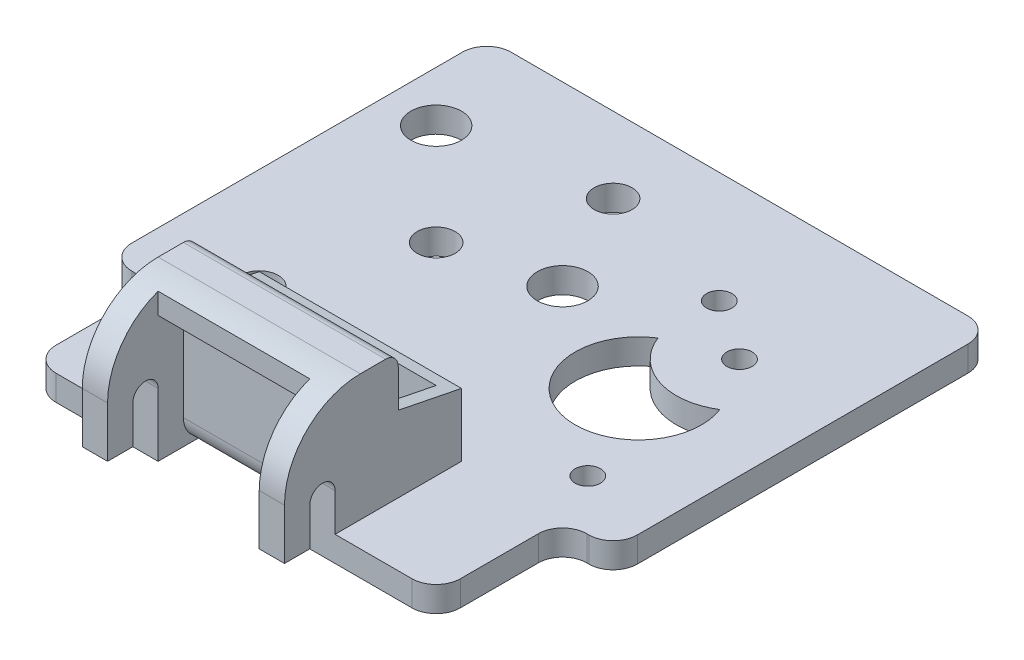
ISO-10303-21;
HEADER;
FILE_DESCRIPTION(('STEP AP214'),'2;1');
FILE_NAME('part.step','',(''),(''),'','','');
FILE_SCHEMA(('AUTOMOTIVE_DESIGN { 1 0 10303 214 1 1 1 1 }'));
ENDSEC;
DATA;
#1=APPLICATION_CONTEXT('core data for automotive mechanical design processes');
#2=APPLICATION_PROTOCOL_DEFINITION('international standard','automotive_design',2000,#1);
#3=PRODUCT_CONTEXT('',#1,'mechanical');
#4=PRODUCT('Part','Part','',(#3));
#5=PRODUCT_RELATED_PRODUCT_CATEGORY('part','',(#4));
#6=PRODUCT_DEFINITION_FORMATION('','',#4);
#7=PRODUCT_DEFINITION_CONTEXT('part definition',#1,'design');
#8=PRODUCT_DEFINITION('design','',#6,#7);
#9=PRODUCT_DEFINITION_SHAPE('','',#8);
#10=(LENGTH_UNIT() NAMED_UNIT(*) SI_UNIT(.MILLI.,.METRE.));
#11=(NAMED_UNIT(*) PLANE_ANGLE_UNIT() SI_UNIT($,.RADIAN.));
#12=(NAMED_UNIT(*) SI_UNIT($,.STERADIAN.) SOLID_ANGLE_UNIT());
#13=UNCERTAINTY_MEASURE_WITH_UNIT(LENGTH_MEASURE(1.E-05),#10,'distance_accuracy_value','');
#14=(GEOMETRIC_REPRESENTATION_CONTEXT(3) GLOBAL_UNCERTAINTY_ASSIGNED_CONTEXT((#13)) GLOBAL_UNIT_ASSIGNED_CONTEXT((#10,
#11,#12)) REPRESENTATION_CONTEXT('',''));
#15=CARTESIAN_POINT('',(0.,0.,0.));
#16=DIRECTION('',(0.,0.,1.));
#17=DIRECTION('',(1.,0.,0.));
#18=AXIS2_PLACEMENT_3D('',#15,#16,#17);
#19=CARTESIAN_POINT('',(-33.5830912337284,12.7,15.8624727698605));
#20=DIRECTION('',(1.,0.,0.));
#21=DIRECTION('',(0.,0.,-1.));
#22=AXIS2_PLACEMENT_3D('',#19,#20,#21);
#23=PLANE('',#22);
#24=DIRECTION('',(0.,-1.,0.));
#25=VECTOR('',#24,1.);
#26=CARTESIAN_POINT('',(-33.5830912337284,12.7,15.8624727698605));
#27=LINE('',#26,#25);
#28=CARTESIAN_POINT('',(-33.5830912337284,7.9375,15.8624727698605));
#29=VERTEX_POINT('',#28);
#30=CARTESIAN_POINT('',(-33.5830912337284,1.5875,15.8624727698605));
#31=VERTEX_POINT('',#30);
#32=EDGE_CURVE('E679',#29,#31,#27,.T.);
#33=ORIENTED_EDGE('',*,*,#32,.F.);
#34=DIRECTION('',(0.,0.,-1.));
#35=VECTOR('',#34,1.);
#36=CARTESIAN_POINT('',(-33.5830912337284,7.9375,17.4499727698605));
#37=LINE('',#36,#35);
#38=CARTESIAN_POINT('',(-33.5830912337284,7.9375,17.4499727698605));
#39=VERTEX_POINT('',#38);
#40=EDGE_CURVE('E1371',#39,#29,#37,.T.);
#41=ORIENTED_EDGE('',*,*,#40,.F.);
#42=DIRECTION('',(0.,-1.,0.));
#43=VECTOR('',#42,1.);
#44=CARTESIAN_POINT('',(-33.5830912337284,9.525,17.4499727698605));
#45=LINE('',#44,#43);
#46=CARTESIAN_POINT('',(-33.5830912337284,9.25262806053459,17.4499727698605));
#47=VERTEX_POINT('',#46);
#48=EDGE_CURVE('E1372',#47,#39,#45,.T.);
#49=ORIENTED_EDGE('',*,*,#48,.F.);
#50=CARTESIAN_POINT('',(-33.5830912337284,4.7625,15.8624727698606));
#51=DIRECTION('',(1.,0.,0.));
#52=DIRECTION('',(0.,0.,-1.));
#53=AXIS2_PLACEMENT_3D('',#50,#51,#52);
#54=CIRCLE('',#53,4.7625);
#55=CARTESIAN_POINT('',(-33.5830912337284,4.76249999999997,20.6249727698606));
#56=VERTEX_POINT('',#55);
#57=EDGE_CURVE('E325',#47,#56,#54,.T.);
#58=ORIENTED_EDGE('',*,*,#57,.T.);
#59=DIRECTION('',(0.,-1.,0.));
#60=VECTOR('',#59,1.);
#61=CARTESIAN_POINT('',(-33.5830912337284,4.76249999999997,20.6249727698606));
#62=LINE('',#61,#60);
#63=CARTESIAN_POINT('',(-33.5830912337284,1.5875,20.6249727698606));
#64=VERTEX_POINT('',#63);
#65=EDGE_CURVE('E704',#56,#64,#62,.T.);
#66=ORIENTED_EDGE('',*,*,#65,.T.);
#67=DIRECTION('',(0.,0.,-1.));
#68=VECTOR('',#67,1.);
#69=CARTESIAN_POINT('',(-33.5830912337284,1.5875,20.6249727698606));
#70=LINE('',#69,#68);
#71=CARTESIAN_POINT('',(-33.5830912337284,1.5875,19.0374727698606));
#72=VERTEX_POINT('',#71);
#73=EDGE_CURVE('E706',#64,#72,#70,.T.);
#74=ORIENTED_EDGE('',*,*,#73,.T.);
#75=DIRECTION('',(0.,1.,0.));
#76=VECTOR('',#75,1.);
#77=CARTESIAN_POINT('',(-33.5830912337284,1.5875,19.0374727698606));
#78=LINE('',#77,#76);
#79=CARTESIAN_POINT('',(-33.5830912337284,3.96875,19.0374727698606));
#80=VERTEX_POINT('',#79);
#81=EDGE_CURVE('E708',#72,#80,#78,.T.);
#82=ORIENTED_EDGE('',*,*,#81,.T.);
#83=CARTESIAN_POINT('',(-33.5830912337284,3.96875,18.2437227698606));
#84=DIRECTION('',(1.,0.,0.));
#85=DIRECTION('',(0.,0.,-1.));
#86=AXIS2_PLACEMENT_3D('',#83,#84,#85);
#87=CIRCLE('',#86,0.793749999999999);
#88=CARTESIAN_POINT('',(-33.5830912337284,3.96875,17.4499727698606));
#89=VERTEX_POINT('',#88);
#90=EDGE_CURVE('E710',#80,#89,#87,.F.);
#91=ORIENTED_EDGE('',*,*,#90,.T.);
#92=DIRECTION('',(0.,-1.,0.));
#93=VECTOR('',#92,1.);
#94=CARTESIAN_POINT('',(-33.5830912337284,1.5875,17.4499727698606));
#95=LINE('',#94,#93);
#96=CARTESIAN_POINT('',(-33.5830912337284,0.,17.4499727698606));
#97=VERTEX_POINT('',#96);
#98=EDGE_CURVE('E689',#89,#97,#95,.T.);
#99=ORIENTED_EDGE('',*,*,#98,.T.);
#100=DIRECTION('',(0.,0.,1.));
#101=VECTOR('',#100,1.);
#102=CARTESIAN_POINT('',(-33.5830912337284,0.,15.8624727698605));
#103=LINE('',#102,#101);
#104=CARTESIAN_POINT('',(-33.5830912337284,0.,14.2749727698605));
#105=VERTEX_POINT('',#104);
#106=EDGE_CURVE('E381',#105,#97,#103,.T.);
#107=ORIENTED_EDGE('',*,*,#106,.F.);
#108=CARTESIAN_POINT('',(-33.5830912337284,1.5875,14.2749727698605));
#109=DIRECTION('',(1.,0.,0.));
#110=DIRECTION('',(0.,0.,-1.));
#111=AXIS2_PLACEMENT_3D('',#108,#109,#110);
#112=CIRCLE('',#111,1.5875);
#113=EDGE_CURVE('E352',#105,#31,#112,.F.);
#114=ORIENTED_EDGE('',*,*,#113,.T.);
#115=EDGE_LOOP('',(#33,#41,#49,#58,#66,#74,#82,#91,#99,#107,#114));
#116=FACE_BOUND('',#115,.T.);
#117=ADVANCED_FACE('F31',(#116),#23,.T.);
#118=CARTESIAN_POINT('',(-24.0580912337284,12.7,15.8624727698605));
#119=DIRECTION('',(-1.,0.,0.));
#120=DIRECTION('',(0.,0.,1.));
#121=AXIS2_PLACEMENT_3D('',#118,#119,#120);
#122=PLANE('',#121);
#123=DIRECTION('',(0.,1.,0.));
#124=VECTOR('',#123,1.);
#125=CARTESIAN_POINT('',(-24.0580912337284,9.525,17.4499727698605));
#126=LINE('',#125,#124);
#127=CARTESIAN_POINT('',(-24.0580912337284,7.9375,17.4499727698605));
#128=VERTEX_POINT('',#127);
#129=CARTESIAN_POINT('',(-24.0580912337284,9.25262806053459,17.4499727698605));
#130=VERTEX_POINT('',#129);
#131=EDGE_CURVE('E329',#128,#130,#126,.T.);
#132=ORIENTED_EDGE('',*,*,#131,.F.);
#133=DIRECTION('',(0.,0.,-1.));
#134=VECTOR('',#133,1.);
#135=CARTESIAN_POINT('',(-24.0580912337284,7.9375,17.4499727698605));
#136=LINE('',#135,#134);
#137=CARTESIAN_POINT('',(-24.0580912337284,7.9375,15.8624727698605));
#138=VERTEX_POINT('',#137);
#139=EDGE_CURVE('E334',#128,#138,#136,.T.);
#140=ORIENTED_EDGE('',*,*,#139,.T.);
#141=DIRECTION('',(0.,-1.,0.));
#142=VECTOR('',#141,1.);
#143=CARTESIAN_POINT('',(-24.0580912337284,12.7,15.8624727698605));
#144=LINE('',#143,#142);
#145=CARTESIAN_POINT('',(-24.0580912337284,1.5875,15.8624727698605));
#146=VERTEX_POINT('',#145);
#147=EDGE_CURVE('E54',#138,#146,#144,.T.);
#148=ORIENTED_EDGE('',*,*,#147,.T.);
#149=CARTESIAN_POINT('',(-24.0580912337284,1.5875,14.2749727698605));
#150=DIRECTION('',(-1.,0.,0.));
#151=DIRECTION('',(0.,0.,1.));
#152=AXIS2_PLACEMENT_3D('',#149,#150,#151);
#153=CIRCLE('',#152,1.5875);
#154=CARTESIAN_POINT('',(-24.0580912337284,0.,14.2749727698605));
#155=VERTEX_POINT('',#154);
#156=EDGE_CURVE('E355',#146,#155,#153,.F.);
#157=ORIENTED_EDGE('',*,*,#156,.T.);
#158=DIRECTION('',(0.,0.,-1.));
#159=VECTOR('',#158,1.);
#160=CARTESIAN_POINT('',(-24.0580912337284,0.,15.8624727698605));
#161=LINE('',#160,#159);
#162=CARTESIAN_POINT('',(-24.0580912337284,0.,17.4499727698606));
#163=VERTEX_POINT('',#162);
#164=EDGE_CURVE('E676',#163,#155,#161,.T.);
#165=ORIENTED_EDGE('',*,*,#164,.F.);
#166=DIRECTION('',(0.,1.,0.));
#167=VECTOR('',#166,1.);
#168=CARTESIAN_POINT('',(-24.0580912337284,1.5875,17.4499727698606));
#169=LINE('',#168,#167);
#170=CARTESIAN_POINT('',(-24.0580912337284,3.96875,17.4499727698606));
#171=VERTEX_POINT('',#170);
#172=EDGE_CURVE('E675',#163,#171,#169,.T.);
#173=ORIENTED_EDGE('',*,*,#172,.T.);
#174=CARTESIAN_POINT('',(-24.0580912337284,3.96875,18.2437227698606));
#175=DIRECTION('',(-1.,0.,0.));
#176=DIRECTION('',(0.,0.,1.));
#177=AXIS2_PLACEMENT_3D('',#174,#175,#176);
#178=CIRCLE('',#177,0.793749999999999);
#179=CARTESIAN_POINT('',(-24.0580912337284,3.96875,19.0374727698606));
#180=VERTEX_POINT('',#179);
#181=EDGE_CURVE('E701',#171,#180,#178,.F.);
#182=ORIENTED_EDGE('',*,*,#181,.T.);
#183=DIRECTION('',(0.,-1.,0.));
#184=VECTOR('',#183,1.);
#185=CARTESIAN_POINT('',(-24.0580912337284,1.5875,19.0374727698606));
#186=LINE('',#185,#184);
#187=CARTESIAN_POINT('',(-24.0580912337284,1.5875,19.0374727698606));
#188=VERTEX_POINT('',#187);
#189=EDGE_CURVE('E699',#180,#188,#186,.T.);
#190=ORIENTED_EDGE('',*,*,#189,.T.);
#191=DIRECTION('',(0.,0.,1.));
#192=VECTOR('',#191,1.);
#193=CARTESIAN_POINT('',(-24.0580912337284,1.5875,20.6249727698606));
#194=LINE('',#193,#192);
#195=CARTESIAN_POINT('',(-24.0580912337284,1.5875,20.6249727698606));
#196=VERTEX_POINT('',#195);
#197=EDGE_CURVE('E697',#188,#196,#194,.T.);
#198=ORIENTED_EDGE('',*,*,#197,.T.);
#199=DIRECTION('',(0.,1.,0.));
#200=VECTOR('',#199,1.);
#201=CARTESIAN_POINT('',(-24.0580912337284,4.76249999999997,20.6249727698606));
#202=LINE('',#201,#200);
#203=CARTESIAN_POINT('',(-24.0580912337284,4.7625,20.6249727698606));
#204=VERTEX_POINT('',#203);
#205=EDGE_CURVE('E338',#196,#204,#202,.T.);
#206=ORIENTED_EDGE('',*,*,#205,.T.);
#207=CARTESIAN_POINT('',(-24.0580912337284,4.7625,15.8624727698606));
#208=DIRECTION('',(-1.,0.,0.));
#209=DIRECTION('',(0.,0.,1.));
#210=AXIS2_PLACEMENT_3D('',#207,#208,#209);
#211=CIRCLE('',#210,4.7625);
#212=EDGE_CURVE('E322',#204,#130,#211,.T.);
#213=ORIENTED_EDGE('',*,*,#212,.T.);
#214=EDGE_LOOP('',(#132,#140,#148,#157,#165,#173,#182,#190,#198,#206,#213));
#215=FACE_BOUND('',#214,.T.);
#216=ADVANCED_FACE('F336',(#215),#122,.T.);
#217=CARTESIAN_POINT('',(-33.5830912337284,12.7,15.8624727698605));
#218=DIRECTION('',(0.,0.,1.));
#219=DIRECTION('',(1.,0.,0.));
#220=AXIS2_PLACEMENT_3D('',#217,#218,#219);
#221=PLANE('',#220);
#222=ORIENTED_EDGE('',*,*,#147,.F.);
#223=DIRECTION('',(1.,0.,0.));
#224=VECTOR('',#223,1.);
#225=CARTESIAN_POINT('',(-33.5830912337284,7.9375,15.8624727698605));
#226=LINE('',#225,#224);
#227=EDGE_CURVE('E1370',#29,#138,#226,.T.);
#228=ORIENTED_EDGE('',*,*,#227,.F.);
#229=ORIENTED_EDGE('',*,*,#32,.T.);
#230=DIRECTION('',(-1.,0.,0.));
#231=VECTOR('',#230,1.);
#232=CARTESIAN_POINT('',(-33.5830912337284,1.5875,15.8624727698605));
#233=LINE('',#232,#231);
#234=EDGE_CURVE('E350',#31,#146,#233,.F.);
#235=ORIENTED_EDGE('',*,*,#234,.T.);
#236=EDGE_LOOP('',(#222,#228,#229,#235));
#237=FACE_BOUND('',#236,.T.);
#238=ADVANCED_FACE('F834',(#237),#221,.T.);
#239=CARTESIAN_POINT('',(-35.1705912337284,5.55625,9.51247276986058));
#240=DIRECTION('',(0.,-0.98058067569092,0.196116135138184));
#241=DIRECTION('',(0.,-0.196116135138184,-0.98058067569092));
#242=AXIS2_PLACEMENT_3D('',#239,#240,#241);
#243=PLANE('',#242);
#244=DIRECTION('',(0.,0.196116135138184,0.98058067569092));
#245=VECTOR('',#244,1.);
#246=CARTESIAN_POINT('',(-34.3768412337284,5.55625,9.51247276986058));
#247=LINE('',#246,#245);
#248=CARTESIAN_POINT('',(-34.3768412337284,5.715,10.3062227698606));
#249=VERTEX_POINT('',#248);
#250=CARTESIAN_POINT('',(-34.3768412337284,6.35,13.4812227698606));
#251=VERTEX_POINT('',#250);
#252=EDGE_CURVE('E39',#249,#251,#247,.T.);
#253=ORIENTED_EDGE('',*,*,#252,.F.);
#254=DIRECTION('',(-1.,0.,0.));
#255=VECTOR('',#254,1.);
#256=CARTESIAN_POINT('',(-35.1705912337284,5.715,10.3062227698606));
#257=LINE('',#256,#255);
#258=CARTESIAN_POINT('',(-23.2643412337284,5.715,10.3062227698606));
#259=VERTEX_POINT('',#258);
#260=EDGE_CURVE('E357',#259,#249,#257,.T.);
#261=ORIENTED_EDGE('',*,*,#260,.F.);
#262=DIRECTION('',(0.,-0.196116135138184,-0.98058067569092));
#263=VECTOR('',#262,1.);
#264=CARTESIAN_POINT('',(-23.2643412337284,5.55625,9.51247276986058));
#265=LINE('',#264,#263);
#266=CARTESIAN_POINT('',(-23.2643412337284,6.35,13.4812227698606));
#267=VERTEX_POINT('',#266);
#268=EDGE_CURVE('E359',#267,#259,#265,.T.);
#269=ORIENTED_EDGE('',*,*,#268,.F.);
#270=DIRECTION('',(1.,0.,0.));
#271=VECTOR('',#270,1.);
#272=CARTESIAN_POINT('',(-35.1705912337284,6.35,13.4812227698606));
#273=LINE('',#272,#271);
#274=CARTESIAN_POINT('',(-22.4705912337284,6.35,13.4812227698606));
#275=VERTEX_POINT('',#274);
#276=EDGE_CURVE('E388',#267,#275,#273,.T.);
#277=ORIENTED_EDGE('',*,*,#276,.T.);
#278=DIRECTION('',(0.,-0.196116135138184,-0.98058067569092));
#279=VECTOR('',#278,1.);
#280=CARTESIAN_POINT('',(-22.4705912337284,5.55625,9.51247276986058));
#281=LINE('',#280,#279);
#282=CARTESIAN_POINT('',(-22.4705912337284,5.55625,9.51247276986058));
#283=VERTEX_POINT('',#282);
#284=EDGE_CURVE('E718',#275,#283,#281,.T.);
#285=ORIENTED_EDGE('',*,*,#284,.T.);
#286=DIRECTION('',(1.,0.,0.));
#287=VECTOR('',#286,1.);
#288=CARTESIAN_POINT('',(-35.1705912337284,5.55625,9.51247276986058));
#289=LINE('',#288,#287);
#290=CARTESIAN_POINT('',(-35.1705912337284,5.55625,9.51247276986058));
#291=VERTEX_POINT('',#290);
#292=EDGE_CURVE('E392',#291,#283,#289,.T.);
#293=ORIENTED_EDGE('',*,*,#292,.F.);
#294=DIRECTION('',(0.,-0.196116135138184,-0.98058067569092));
#295=VECTOR('',#294,1.);
#296=CARTESIAN_POINT('',(-35.1705912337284,5.55625,9.51247276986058));
#297=LINE('',#296,#295);
#298=CARTESIAN_POINT('',(-35.1705912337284,6.35,13.4812227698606));
#299=VERTEX_POINT('',#298);
#300=EDGE_CURVE('E386',#299,#291,#297,.T.);
#301=ORIENTED_EDGE('',*,*,#300,.F.);
#302=EDGE_CURVE('E376',#299,#251,#273,.T.);
#303=ORIENTED_EDGE('',*,*,#302,.T.);
#304=EDGE_LOOP('',(#253,#261,#269,#277,#285,#293,#301,#303));
#305=FACE_BOUND('',#304,.T.);
#306=ADVANCED_FACE('F384',(#305),#243,.F.);
#307=CARTESIAN_POINT('',(-43.1715912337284,0.,-12.7760272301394));
#308=DIRECTION('',(0.,-1.,0.));
#309=DIRECTION('',(0.,0.,-1.));
#310=AXIS2_PLACEMENT_3D('',#307,#308,#309);
#311=PLANE('',#310);
#312=CARTESIAN_POINT('',(-17.7080912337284,0.,6.33747276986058));
#313=DIRECTION('',(0.,1.,0.));
#314=DIRECTION('',(0.,0.,1.));
#315=AXIS2_PLACEMENT_3D('',#312,#313,#314);
#316=CIRCLE('',#315,0.79375);
#317=CARTESIAN_POINT('',(-17.7080912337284,0.,7.13122276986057));
#318=VERTEX_POINT('',#317);
#319=EDGE_CURVE('E421',#318,#318,#316,.T.);
#320=ORIENTED_EDGE('',*,*,#319,.T.);
#321=EDGE_LOOP('',(#320));
#322=FACE_BOUND('',#321,.T.);
#323=CARTESIAN_POINT('',(-19.2955912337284,0.,-4.77502723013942));
#324=DIRECTION('',(0.,1.,0.));
#325=DIRECTION('',(0.,0.,1.));
#326=AXIS2_PLACEMENT_3D('',#323,#324,#325);
#327=CIRCLE('',#326,0.79375);
#328=CARTESIAN_POINT('',(-19.2955912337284,0.,-3.98127723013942));
#329=VERTEX_POINT('',#328);
#330=EDGE_CURVE('E444',#329,#329,#327,.T.);
#331=ORIENTED_EDGE('',*,*,#330,.T.);
#332=EDGE_LOOP('',(#331));
#333=FACE_BOUND('',#332,.T.);
#334=CARTESIAN_POINT('',(-28.8205912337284,0.,-3.18752723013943));
#335=DIRECTION('',(0.,1.,0.));
#336=DIRECTION('',(0.,0.,1.));
#337=AXIS2_PLACEMENT_3D('',#334,#335,#336);
#338=CIRCLE('',#337,1.5875);
#339=CARTESIAN_POINT('',(-28.8205912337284,0.,-1.60002723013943));
#340=VERTEX_POINT('',#339);
#341=EDGE_CURVE('E454',#340,#340,#338,.T.);
#342=ORIENTED_EDGE('',*,*,#341,.T.);
#343=EDGE_LOOP('',(#342));
#344=FACE_BOUND('',#343,.T.);
#345=CARTESIAN_POINT('',(-38.3455912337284,0.,6.33747276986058));
#346=DIRECTION('',(0.,1.,0.));
#347=DIRECTION('',(0.,0.,1.));
#348=AXIS2_PLACEMENT_3D('',#345,#346,#347);
#349=CIRCLE('',#348,1.190625);
#350=CARTESIAN_POINT('',(-38.3455912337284,0.,7.52809776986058));
#351=VERTEX_POINT('',#350);
#352=EDGE_CURVE('E466',#351,#351,#349,.T.);
#353=ORIENTED_EDGE('',*,*,#352,.T.);
#354=EDGE_LOOP('',(#353));
#355=FACE_BOUND('',#354,.T.);
#356=CARTESIAN_POINT('',(-41.5205912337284,0.,-7.95002723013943));
#357=DIRECTION('',(0.,1.,0.));
#358=DIRECTION('',(0.,0.,1.));
#359=AXIS2_PLACEMENT_3D('',#356,#357,#358);
#360=CIRCLE('',#359,1.5875);
#361=CARTESIAN_POINT('',(-41.5205912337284,0.,-6.36252723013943));
#362=VERTEX_POINT('',#361);
#363=EDGE_CURVE('E478',#362,#362,#360,.T.);
#364=ORIENTED_EDGE('',*,*,#363,.T.);
#365=EDGE_LOOP('',(#364));
#366=FACE_BOUND('',#365,.T.);
#367=CARTESIAN_POINT('',(-35.1705912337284,0.,-1.60002723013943));
#368=DIRECTION('',(0.,1.,0.));
#369=DIRECTION('',(0.,0.,1.));
#370=AXIS2_PLACEMENT_3D('',#367,#368,#369);
#371=CIRCLE('',#370,1.190625);
#372=CARTESIAN_POINT('',(-35.1705912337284,0.,-0.409402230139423));
#373=VERTEX_POINT('',#372);
#374=EDGE_CURVE('E472',#373,#373,#371,.T.);
#375=ORIENTED_EDGE('',*,*,#374,.T.);
#376=EDGE_LOOP('',(#375));
#377=FACE_BOUND('',#376,.T.);
#378=CARTESIAN_POINT('',(-31.9955912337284,0.,-9.53752723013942));
#379=DIRECTION('',(0.,1.,0.));
#380=DIRECTION('',(0.,0.,1.));
#381=AXIS2_PLACEMENT_3D('',#378,#379,#380);
#382=CIRCLE('',#381,1.190625);
#383=CARTESIAN_POINT('',(-31.9955912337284,0.,-8.34690223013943));
#384=VERTEX_POINT('',#383);
#385=EDGE_CURVE('E460',#384,#384,#382,.T.);
#386=ORIENTED_EDGE('',*,*,#385,.T.);
#387=EDGE_LOOP('',(#386));
#388=FACE_BOUND('',#387,.T.);
#389=CARTESIAN_POINT('',(-23.1055912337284,0.,-7.31502723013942));
#390=DIRECTION('',(0.,1.,0.));
#391=DIRECTION('',(0.,0.,1.));
#392=AXIS2_PLACEMENT_3D('',#389,#390,#391);
#393=CIRCLE('',#392,0.79375);
#394=CARTESIAN_POINT('',(-23.1055912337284,0.,-6.52127723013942));
#395=VERTEX_POINT('',#394);
#396=EDGE_CURVE('E448',#395,#395,#393,.T.);
#397=ORIENTED_EDGE('',*,*,#396,.T.);
#398=EDGE_LOOP('',(#397));
#399=FACE_BOUND('',#398,.T.);
#400=CARTESIAN_POINT('',(-20.8830912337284,0.,-0.0125272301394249));
#401=DIRECTION('',(0.,1.,0.));
#402=DIRECTION('',(0.,0.,1.));
#403=AXIS2_PLACEMENT_3D('',#400,#401,#402);
#404=CIRCLE('',#403,3.96875);
#405=CARTESIAN_POINT('',(-23.0057649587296,0.,-3.3659184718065));
#406=VERTEX_POINT('',#405);
#407=CARTESIAN_POINT('',(-17.1729175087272,0.,-1.42163598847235));
#408=VERTEX_POINT('',#407);
#409=EDGE_CURVE('E432',#406,#408,#404,.T.);
#410=ORIENTED_EDGE('',*,*,#409,.T.);
#411=CARTESIAN_POINT('',(-19.2955912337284,0.,-4.77502723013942));
#412=DIRECTION('',(0.,-1.,0.));
#413=DIRECTION('',(0.,0.,1.));
#414=AXIS2_PLACEMENT_3D('',#411,#412,#413);
#415=CIRCLE('',#414,3.96875);
#416=EDGE_CURVE('E425',#408,#406,#415,.T.);
#417=ORIENTED_EDGE('',*,*,#416,.T.);
#418=EDGE_LOOP('',(#410,#417));
#419=FACE_BOUND('',#418,.T.);
#420=DIRECTION('',(-1.,0.,0.));
#421=VECTOR('',#420,1.);
#422=CARTESIAN_POINT('',(-43.1715912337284,0.,14.2749727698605));
#423=LINE('',#422,#421);
#424=EDGE_CURVE('E341',#155,#105,#423,.T.);
#425=ORIENTED_EDGE('',*,*,#424,.T.);
#426=ORIENTED_EDGE('',*,*,#106,.T.);
#427=DIRECTION('',(1.,0.,0.));
#428=VECTOR('',#427,1.);
#429=CARTESIAN_POINT('',(-17.6445912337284,0.,17.4499727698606));
#430=LINE('',#429,#428);
#431=CARTESIAN_POINT('',(-39.9965912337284,0.,17.4499727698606));
#432=VERTEX_POINT('',#431);
#433=EDGE_CURVE('E538',#432,#97,#430,.T.);
#434=ORIENTED_EDGE('',*,*,#433,.F.);
#435=CARTESIAN_POINT('',(-39.9965912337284,0.,15.9259727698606));
#436=DIRECTION('',(0.,1.,0.));
#437=DIRECTION('',(0.,0.,-1.));
#438=AXIS2_PLACEMENT_3D('',#435,#436,#437);
#439=CIRCLE('',#438,1.524);
#440=CARTESIAN_POINT('',(-41.5205912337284,0.,15.9259727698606));
#441=VERTEX_POINT('',#440);
#442=EDGE_CURVE('E535',#441,#432,#439,.T.);
#443=ORIENTED_EDGE('',*,*,#442,.F.);
#444=DIRECTION('',(0.,0.,1.));
#445=VECTOR('',#444,1.);
#446=CARTESIAN_POINT('',(-41.5205912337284,0.,15.9259727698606));
#447=LINE('',#446,#445);
#448=CARTESIAN_POINT('',(-41.5205912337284,0.,11.0364727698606));
#449=VERTEX_POINT('',#448);
#450=EDGE_CURVE('E533',#449,#441,#447,.T.);
#451=ORIENTED_EDGE('',*,*,#450,.F.);
#452=CARTESIAN_POINT('',(-43.0445912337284,0.,11.0364727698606));
#453=DIRECTION('',(0.,-1.,0.));
#454=DIRECTION('',(0.,0.,1.));
#455=AXIS2_PLACEMENT_3D('',#452,#453,#454);
#456=CIRCLE('',#455,1.524);
#457=CARTESIAN_POINT('',(-43.0445912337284,0.,9.51247276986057));
#458=VERTEX_POINT('',#457);
#459=EDGE_CURVE('E531',#458,#449,#456,.T.);
#460=ORIENTED_EDGE('',*,*,#459,.F.);
#461=DIRECTION('',(1.,0.,0.));
#462=VECTOR('',#461,1.);
#463=CARTESIAN_POINT('',(-43.0445912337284,0.,9.51247276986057));
#464=LINE('',#463,#462);
#465=CARTESIAN_POINT('',(-43.1715912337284,0.,9.51247276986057));
#466=VERTEX_POINT('',#465);
#467=EDGE_CURVE('E529',#466,#458,#464,.T.);
#468=ORIENTED_EDGE('',*,*,#467,.F.);
#469=CARTESIAN_POINT('',(-43.1715912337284,0.,7.98847276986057));
#470=DIRECTION('',(0.,1.,0.));
#471=DIRECTION('',(0.,0.,-1.));
#472=AXIS2_PLACEMENT_3D('',#469,#470,#471);
#473=CIRCLE('',#472,1.524);
#474=CARTESIAN_POINT('',(-44.6955912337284,0.,7.98847276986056));
#475=VERTEX_POINT('',#474);
#476=EDGE_CURVE('E527',#475,#466,#473,.T.);
#477=ORIENTED_EDGE('',*,*,#476,.F.);
#478=DIRECTION('',(0.,0.,1.));
#479=VECTOR('',#478,1.);
#480=CARTESIAN_POINT('',(-44.6955912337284,0.,7.98847276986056));
#481=LINE('',#480,#479);
#482=CARTESIAN_POINT('',(-44.6955912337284,0.,-12.7760272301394));
#483=VERTEX_POINT('',#482);
#484=EDGE_CURVE('E525',#483,#475,#481,.T.);
#485=ORIENTED_EDGE('',*,*,#484,.F.);
#486=CARTESIAN_POINT('',(-43.1715912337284,0.,-12.7760272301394));
#487=DIRECTION('',(0.,1.,0.));
#488=DIRECTION('',(0.,0.,-1.));
#489=AXIS2_PLACEMENT_3D('',#486,#487,#488);
#490=CIRCLE('',#489,1.524);
#491=CARTESIAN_POINT('',(-43.1715912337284,0.,-14.3000272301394));
#492=VERTEX_POINT('',#491);
#493=EDGE_CURVE('E484',#492,#483,#490,.T.);
#494=ORIENTED_EDGE('',*,*,#493,.F.);
#495=DIRECTION('',(-1.,0.,0.));
#496=VECTOR('',#495,1.);
#497=CARTESIAN_POINT('',(-43.1715912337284,0.,-14.3000272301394));
#498=LINE('',#497,#496);
#499=CARTESIAN_POINT('',(-14.4695912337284,0.,-14.3000272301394));
#500=VERTEX_POINT('',#499);
#501=EDGE_CURVE('E491',#500,#492,#498,.T.);
#502=ORIENTED_EDGE('',*,*,#501,.F.);
#503=CARTESIAN_POINT('',(-14.4695912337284,0.,-12.7760272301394));
#504=DIRECTION('',(0.,1.,0.));
#505=DIRECTION('',(0.,0.,-1.));
#506=AXIS2_PLACEMENT_3D('',#503,#504,#505);
#507=CIRCLE('',#506,1.524);
#508=CARTESIAN_POINT('',(-12.9455912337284,0.,-12.7760272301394));
#509=VERTEX_POINT('',#508);
#510=EDGE_CURVE('E553',#509,#500,#507,.T.);
#511=ORIENTED_EDGE('',*,*,#510,.F.);
#512=DIRECTION('',(0.,0.,-1.));
#513=VECTOR('',#512,1.);
#514=CARTESIAN_POINT('',(-12.9455912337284,0.,-12.7760272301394));
#515=LINE('',#514,#513);
#516=CARTESIAN_POINT('',(-12.9455912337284,0.,7.98847276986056));
#517=VERTEX_POINT('',#516);
#518=EDGE_CURVE('E551',#517,#509,#515,.T.);
#519=ORIENTED_EDGE('',*,*,#518,.F.);
#520=CARTESIAN_POINT('',(-14.4695912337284,0.,7.98847276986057));
#521=DIRECTION('',(0.,1.,0.));
#522=DIRECTION('',(0.,0.,-1.));
#523=AXIS2_PLACEMENT_3D('',#520,#521,#522);
#524=CIRCLE('',#523,1.524);
#525=CARTESIAN_POINT('',(-14.4695912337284,0.,9.51247276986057));
#526=VERTEX_POINT('',#525);
#527=EDGE_CURVE('E549',#526,#517,#524,.T.);
#528=ORIENTED_EDGE('',*,*,#527,.F.);
#529=DIRECTION('',(1.,0.,0.));
#530=VECTOR('',#529,1.);
#531=CARTESIAN_POINT('',(-14.4695912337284,0.,9.51247276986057));
#532=LINE('',#531,#530);
#533=CARTESIAN_POINT('',(-14.5965912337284,0.,9.51247276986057));
#534=VERTEX_POINT('',#533);
#535=EDGE_CURVE('E547',#534,#526,#532,.T.);
#536=ORIENTED_EDGE('',*,*,#535,.F.);
#537=CARTESIAN_POINT('',(-14.5965912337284,0.,11.0364727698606));
#538=DIRECTION('',(0.,-1.,0.));
#539=DIRECTION('',(0.,0.,-1.));
#540=AXIS2_PLACEMENT_3D('',#537,#538,#539);
#541=CIRCLE('',#540,1.524);
#542=CARTESIAN_POINT('',(-16.1205912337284,0.,11.0364727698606));
#543=VERTEX_POINT('',#542);
#544=EDGE_CURVE('E545',#543,#534,#541,.T.);
#545=ORIENTED_EDGE('',*,*,#544,.F.);
#546=DIRECTION('',(0.,0.,-1.));
#547=VECTOR('',#546,1.);
#548=CARTESIAN_POINT('',(-16.1205912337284,0.,11.0364727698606));
#549=LINE('',#548,#547);
#550=CARTESIAN_POINT('',(-16.1205912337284,0.,15.9259727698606));
#551=VERTEX_POINT('',#550);
#552=EDGE_CURVE('E543',#551,#543,#549,.T.);
#553=ORIENTED_EDGE('',*,*,#552,.F.);
#554=CARTESIAN_POINT('',(-17.6445912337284,0.,15.9259727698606));
#555=DIRECTION('',(0.,1.,0.));
#556=DIRECTION('',(0.,0.,-1.));
#557=AXIS2_PLACEMENT_3D('',#554,#555,#556);
#558=CIRCLE('',#557,1.524);
#559=CARTESIAN_POINT('',(-17.6445912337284,0.,17.4499727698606));
#560=VERTEX_POINT('',#559);
#561=EDGE_CURVE('E541',#560,#551,#558,.T.);
#562=ORIENTED_EDGE('',*,*,#561,.F.);
#563=EDGE_CURVE('E537',#163,#560,#430,.T.);
#564=ORIENTED_EDGE('',*,*,#563,.F.);
#565=ORIENTED_EDGE('',*,*,#164,.T.);
#566=EDGE_LOOP('',(#425,#426,#434,#443,#451,#460,#468,#477,#485,#494,#502,#511,#519,#528,#536,
#545,#553,#562,#564,#565));
#567=FACE_BOUND('',#566,.T.);
#568=ADVANCED_FACE('F606',(#322,#333,#344,#355,#366,#377,#388,#399,#419,#567),#311,.T.);
#569=CARTESIAN_POINT('',(-17.6445912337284,1.5875,17.4499727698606));
#570=DIRECTION('',(0.,0.,-1.));
#571=DIRECTION('',(-1.,0.,0.));
#572=AXIS2_PLACEMENT_3D('',#569,#570,#571);
#573=PLANE('',#572);
#574=ORIENTED_EDGE('',*,*,#98,.F.);
#575=DIRECTION('',(1.,0.,0.));
#576=VECTOR('',#575,1.);
#577=CARTESIAN_POINT('',(-35.1705912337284,3.96875,17.4499727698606));
#578=LINE('',#577,#576);
#579=CARTESIAN_POINT('',(-35.1705912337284,3.96875,17.4499727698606));
#580=VERTEX_POINT('',#579);
#581=EDGE_CURVE('E416',#580,#89,#578,.T.);
#582=ORIENTED_EDGE('',*,*,#581,.F.);
#583=DIRECTION('',(0.,1.,0.));
#584=VECTOR('',#583,1.);
#585=CARTESIAN_POINT('',(-35.1705912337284,1.5875,17.4499727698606));
#586=LINE('',#585,#584);
#587=CARTESIAN_POINT('',(-35.1705912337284,1.5875,17.4499727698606));
#588=VERTEX_POINT('',#587);
#589=EDGE_CURVE('E721',#588,#580,#586,.T.);
#590=ORIENTED_EDGE('',*,*,#589,.F.);
#591=DIRECTION('',(1.,0.,0.));
#592=VECTOR('',#591,1.);
#593=CARTESIAN_POINT('',(-17.6445912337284,1.5875,17.4499727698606));
#594=LINE('',#593,#592);
#595=CARTESIAN_POINT('',(-39.9965912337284,1.5875,17.4499727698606));
#596=VERTEX_POINT('',#595);
#597=EDGE_CURVE('E504',#596,#588,#594,.T.);
#598=ORIENTED_EDGE('',*,*,#597,.F.);
#599=DIRECTION('',(0.,-1.,0.));
#600=VECTOR('',#599,1.);
#601=CARTESIAN_POINT('',(-39.9965912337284,1.5875,17.4499727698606));
#602=LINE('',#601,#600);
#603=EDGE_CURVE('E582',#596,#432,#602,.T.);
#604=ORIENTED_EDGE('',*,*,#603,.T.);
#605=ORIENTED_EDGE('',*,*,#433,.T.);
#606=EDGE_LOOP('',(#574,#582,#590,#598,#604,#605));
#607=FACE_BOUND('',#606,.T.);
#608=ADVANCED_FACE('F877',(#607),#573,.F.);
#609=ORIENTED_EDGE('',*,*,#172,.F.);
#610=ORIENTED_EDGE('',*,*,#563,.T.);
#611=DIRECTION('',(0.,-1.,0.));
#612=VECTOR('',#611,1.);
#613=CARTESIAN_POINT('',(-17.6445912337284,1.5875,17.4499727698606));
#614=LINE('',#613,#612);
#615=CARTESIAN_POINT('',(-17.6445912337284,1.5875,17.4499727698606));
#616=VERTEX_POINT('',#615);
#617=EDGE_CURVE('E579',#616,#560,#614,.T.);
#618=ORIENTED_EDGE('',*,*,#617,.F.);
#619=CARTESIAN_POINT('',(-22.4705912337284,1.5875,17.4499727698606));
#620=VERTEX_POINT('',#619);
#621=EDGE_CURVE('E503',#620,#616,#594,.T.);
#622=ORIENTED_EDGE('',*,*,#621,.F.);
#623=DIRECTION('',(0.,1.,0.));
#624=VECTOR('',#623,1.);
#625=CARTESIAN_POINT('',(-22.4705912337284,1.5875,17.4499727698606));
#626=LINE('',#625,#624);
#627=CARTESIAN_POINT('',(-22.4705912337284,3.96875,17.4499727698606));
#628=VERTEX_POINT('',#627);
#629=EDGE_CURVE('E744',#620,#628,#626,.T.);
#630=ORIENTED_EDGE('',*,*,#629,.T.);
#631=EDGE_CURVE('E415',#171,#628,#578,.T.);
#632=ORIENTED_EDGE('',*,*,#631,.F.);
#633=EDGE_LOOP('',(#609,#610,#618,#622,#630,#632));
#634=FACE_BOUND('',#633,.T.);
#635=ADVANCED_FACE('F671',(#634),#573,.F.);
#636=CARTESIAN_POINT('',(-35.1705912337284,3.96875,18.2437227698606));
#637=DIRECTION('',(1.,0.,0.));
#638=DIRECTION('',(0.,0.,-1.));
#639=AXIS2_PLACEMENT_3D('',#636,#637,#638);
#640=CYLINDRICAL_SURFACE('',#639,0.793749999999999);
#641=ORIENTED_EDGE('',*,*,#90,.F.);
#642=DIRECTION('',(1.,0.,0.));
#643=VECTOR('',#642,1.);
#644=CARTESIAN_POINT('',(-35.1705912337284,3.96875,19.0374727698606));
#645=LINE('',#644,#643);
#646=CARTESIAN_POINT('',(-35.1705912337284,3.96875,19.0374727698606));
#647=VERTEX_POINT('',#646);
#648=EDGE_CURVE('E412',#647,#80,#645,.T.);
#649=ORIENTED_EDGE('',*,*,#648,.F.);
#650=CARTESIAN_POINT('',(-35.1705912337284,3.96875,18.2437227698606));
#651=DIRECTION('',(1.,0.,0.));
#652=DIRECTION('',(0.,0.,1.));
#653=AXIS2_PLACEMENT_3D('',#650,#651,#652);
#654=CIRCLE('',#653,0.793749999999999);
#655=EDGE_CURVE('E723',#580,#647,#654,.T.);
#656=ORIENTED_EDGE('',*,*,#655,.F.);
#657=ORIENTED_EDGE('',*,*,#581,.T.);
#658=EDGE_LOOP('',(#641,#649,#656,#657));
#659=FACE_BOUND('',#658,.T.);
#660=ADVANCED_FACE('F819',(#659),#640,.F.);
#661=ORIENTED_EDGE('',*,*,#181,.F.);
#662=ORIENTED_EDGE('',*,*,#631,.T.);
#663=CARTESIAN_POINT('',(-22.4705912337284,3.96875,18.2437227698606));
#664=DIRECTION('',(1.,0.,0.));
#665=DIRECTION('',(0.,0.,1.));
#666=AXIS2_PLACEMENT_3D('',#663,#664,#665);
#667=CIRCLE('',#666,0.793749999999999);
#668=CARTESIAN_POINT('',(-22.4705912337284,3.96875,19.0374727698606));
#669=VERTEX_POINT('',#668);
#670=EDGE_CURVE('E746',#628,#669,#667,.T.);
#671=ORIENTED_EDGE('',*,*,#670,.T.);
#672=EDGE_CURVE('E411',#180,#669,#645,.T.);
#673=ORIENTED_EDGE('',*,*,#672,.F.);
#674=EDGE_LOOP('',(#661,#662,#671,#673));
#675=FACE_BOUND('',#674,.T.);
#676=ADVANCED_FACE('F816',(#675),#640,.F.);
#677=CARTESIAN_POINT('',(-35.1705912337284,1.5875,19.0374727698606));
#678=DIRECTION('',(0.,0.,1.));
#679=DIRECTION('',(1.,0.,0.));
#680=AXIS2_PLACEMENT_3D('',#677,#678,#679);
#681=PLANE('',#680);
#682=ORIENTED_EDGE('',*,*,#81,.F.);
#683=DIRECTION('',(1.,0.,0.));
#684=VECTOR('',#683,1.);
#685=CARTESIAN_POINT('',(-35.1705912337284,1.5875,19.0374727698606));
#686=LINE('',#685,#684);
#687=CARTESIAN_POINT('',(-35.1705912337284,1.5875,19.0374727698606));
#688=VERTEX_POINT('',#687);
#689=EDGE_CURVE('E408',#688,#72,#686,.T.);
#690=ORIENTED_EDGE('',*,*,#689,.F.);
#691=DIRECTION('',(0.,-1.,0.));
#692=VECTOR('',#691,1.);
#693=CARTESIAN_POINT('',(-35.1705912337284,1.5875,19.0374727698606));
#694=LINE('',#693,#692);
#695=EDGE_CURVE('E725',#647,#688,#694,.T.);
#696=ORIENTED_EDGE('',*,*,#695,.F.);
#697=ORIENTED_EDGE('',*,*,#648,.T.);
#698=EDGE_LOOP('',(#682,#690,#696,#697));
#699=FACE_BOUND('',#698,.T.);
#700=ADVANCED_FACE('F818',(#699),#681,.F.);
#701=ORIENTED_EDGE('',*,*,#189,.F.);
#702=ORIENTED_EDGE('',*,*,#672,.T.);
#703=DIRECTION('',(0.,-1.,0.));
#704=VECTOR('',#703,1.);
#705=CARTESIAN_POINT('',(-22.4705912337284,1.5875,19.0374727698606));
#706=LINE('',#705,#704);
#707=CARTESIAN_POINT('',(-22.4705912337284,1.5875,19.0374727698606));
#708=VERTEX_POINT('',#707);
#709=EDGE_CURVE('E749',#669,#708,#706,.T.);
#710=ORIENTED_EDGE('',*,*,#709,.T.);
#711=EDGE_CURVE('E407',#188,#708,#686,.T.);
#712=ORIENTED_EDGE('',*,*,#711,.F.);
#713=EDGE_LOOP('',(#701,#702,#710,#712));
#714=FACE_BOUND('',#713,.T.);
#715=ADVANCED_FACE('F812',(#714),#681,.F.);
#716=CARTESIAN_POINT('',(-35.1705912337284,1.5875,20.6249727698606));
#717=DIRECTION('',(0.,1.,0.));
#718=DIRECTION('',(-1.,0.,0.));
#719=AXIS2_PLACEMENT_3D('',#716,#717,#718);
#720=PLANE('',#719);
#721=ORIENTED_EDGE('',*,*,#73,.F.);
#722=DIRECTION('',(1.,0.,0.));
#723=VECTOR('',#722,1.);
#724=CARTESIAN_POINT('',(-35.1705912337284,1.5875,20.6249727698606));
#725=LINE('',#724,#723);
#726=CARTESIAN_POINT('',(-35.1705912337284,1.5875,20.6249727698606));
#727=VERTEX_POINT('',#726);
#728=EDGE_CURVE('E404',#727,#64,#725,.T.);
#729=ORIENTED_EDGE('',*,*,#728,.F.);
#730=DIRECTION('',(0.,0.,1.));
#731=VECTOR('',#730,1.);
#732=CARTESIAN_POINT('',(-35.1705912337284,1.5875,20.6249727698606));
#733=LINE('',#732,#731);
#734=EDGE_CURVE('E727',#688,#727,#733,.T.);
#735=ORIENTED_EDGE('',*,*,#734,.F.);
#736=ORIENTED_EDGE('',*,*,#689,.T.);
#737=EDGE_LOOP('',(#721,#729,#735,#736));
#738=FACE_BOUND('',#737,.T.);
#739=ADVANCED_FACE('F856',(#738),#720,.F.);
#740=ORIENTED_EDGE('',*,*,#197,.F.);
#741=ORIENTED_EDGE('',*,*,#711,.T.);
#742=DIRECTION('',(0.,0.,1.));
#743=VECTOR('',#742,1.);
#744=CARTESIAN_POINT('',(-22.4705912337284,1.5875,20.6249727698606));
#745=LINE('',#744,#743);
#746=CARTESIAN_POINT('',(-22.4705912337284,1.5875,20.6249727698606));
#747=VERTEX_POINT('',#746);
#748=EDGE_CURVE('E752',#708,#747,#745,.T.);
#749=ORIENTED_EDGE('',*,*,#748,.T.);
#750=EDGE_CURVE('E403',#196,#747,#725,.T.);
#751=ORIENTED_EDGE('',*,*,#750,.F.);
#752=EDGE_LOOP('',(#740,#741,#749,#751));
#753=FACE_BOUND('',#752,.T.);
#754=ADVANCED_FACE('F808',(#753),#720,.F.);
#755=CARTESIAN_POINT('',(-35.1705912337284,4.76249999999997,20.6249727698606));
#756=DIRECTION('',(0.,0.,-1.));
#757=DIRECTION('',(-1.,0.,0.));
#758=AXIS2_PLACEMENT_3D('',#755,#756,#757);
#759=PLANE('',#758);
#760=ORIENTED_EDGE('',*,*,#65,.F.);
#761=DIRECTION('',(1.,0.,0.));
#762=VECTOR('',#761,1.);
#763=CARTESIAN_POINT('',(-35.1705912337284,4.76249999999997,20.6249727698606));
#764=LINE('',#763,#762);
#765=CARTESIAN_POINT('',(-35.1705912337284,4.76249999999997,20.6249727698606));
#766=VERTEX_POINT('',#765);
#767=EDGE_CURVE('E401',#766,#56,#764,.T.);
#768=ORIENTED_EDGE('',*,*,#767,.F.);
#769=DIRECTION('',(0.,1.,0.));
#770=VECTOR('',#769,1.);
#771=CARTESIAN_POINT('',(-35.1705912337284,4.76249999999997,20.6249727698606));
#772=LINE('',#771,#770);
#773=EDGE_CURVE('E729',#727,#766,#772,.T.);
#774=ORIENTED_EDGE('',*,*,#773,.F.);
#775=ORIENTED_EDGE('',*,*,#728,.T.);
#776=EDGE_LOOP('',(#760,#768,#774,#775));
#777=FACE_BOUND('',#776,.T.);
#778=ADVANCED_FACE('F852',(#777),#759,.F.);
#779=ORIENTED_EDGE('',*,*,#205,.F.);
#780=ORIENTED_EDGE('',*,*,#750,.T.);
#781=DIRECTION('',(0.,1.,0.));
#782=VECTOR('',#781,1.);
#783=CARTESIAN_POINT('',(-22.4705912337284,4.76249999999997,20.6249727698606));
#784=LINE('',#783,#782);
#785=CARTESIAN_POINT('',(-22.4705912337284,4.76249999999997,20.6249727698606));
#786=VERTEX_POINT('',#785);
#787=EDGE_CURVE('E755',#747,#786,#784,.T.);
#788=ORIENTED_EDGE('',*,*,#787,.T.);
#789=EDGE_CURVE('E400',#204,#786,#764,.T.);
#790=ORIENTED_EDGE('',*,*,#789,.F.);
#791=EDGE_LOOP('',(#779,#780,#788,#790));
#792=FACE_BOUND('',#791,.T.);
#793=ADVANCED_FACE('F802',(#792),#759,.F.);
#794=CARTESIAN_POINT('',(-35.1705912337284,4.7625,15.8624727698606));
#795=DIRECTION('',(1.,0.,0.));
#796=DIRECTION('',(0.,0.,-1.));
#797=AXIS2_PLACEMENT_3D('',#794,#795,#796);
#798=CYLINDRICAL_SURFACE('',#797,4.7625);
#799=ORIENTED_EDGE('',*,*,#212,.F.);
#800=ORIENTED_EDGE('',*,*,#789,.T.);
#801=CARTESIAN_POINT('',(-22.4705912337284,4.7625,15.8624727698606));
#802=DIRECTION('',(-1.,0.,0.));
#803=DIRECTION('',(0.,0.,-1.));
#804=AXIS2_PLACEMENT_3D('',#801,#802,#803);
#805=CIRCLE('',#804,4.7625);
#806=CARTESIAN_POINT('',(-22.4705912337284,9.525,15.8624727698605));
#807=VERTEX_POINT('',#806);
#808=EDGE_CURVE('E758',#786,#807,#805,.T.);
#809=ORIENTED_EDGE('',*,*,#808,.T.);
#810=DIRECTION('',(1.,0.,0.));
#811=VECTOR('',#810,1.);
#812=CARTESIAN_POINT('',(-35.1705912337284,9.525,15.8624727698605));
#813=LINE('',#812,#811);
#814=CARTESIAN_POINT('',(-35.1705912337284,9.525,15.8624727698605));
#815=VERTEX_POINT('',#814);
#816=EDGE_CURVE('E398',#815,#807,#813,.T.);
#817=ORIENTED_EDGE('',*,*,#816,.F.);
#818=CARTESIAN_POINT('',(-35.1705912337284,4.7625,15.8624727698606));
#819=DIRECTION('',(-1.,0.,0.));
#820=DIRECTION('',(0.,0.,-1.));
#821=AXIS2_PLACEMENT_3D('',#818,#819,#820);
#822=CIRCLE('',#821,4.7625);
#823=EDGE_CURVE('E731',#766,#815,#822,.T.);
#824=ORIENTED_EDGE('',*,*,#823,.F.);
#825=ORIENTED_EDGE('',*,*,#767,.T.);
#826=ORIENTED_EDGE('',*,*,#57,.F.);
#827=DIRECTION('',(-1.,0.,0.));
#828=VECTOR('',#827,1.);
#829=CARTESIAN_POINT('',(-22.4705912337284,9.25262806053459,17.4499727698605));
#830=LINE('',#829,#828);
#831=EDGE_CURVE('E11',#47,#130,#830,.F.);
#832=ORIENTED_EDGE('',*,*,#831,.T.);
#833=EDGE_LOOP('',(#799,#800,#809,#817,#824,#825,#826,#832));
#834=FACE_BOUND('',#833,.T.);
#835=ADVANCED_FACE('F320',(#834),#798,.T.);
#836=CARTESIAN_POINT('',(-43.1715912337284,1.5875,-12.7760272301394));
#837=DIRECTION('',(0.,-1.,0.));
#838=DIRECTION('',(0.,0.,-1.));
#839=AXIS2_PLACEMENT_3D('',#836,#837,#838);
#840=PLANE('',#839);
#841=CARTESIAN_POINT('',(-17.7080912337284,1.5875,6.33747276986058));
#842=DIRECTION('',(0.,1.,0.));
#843=DIRECTION('',(0.,0.,1.));
#844=AXIS2_PLACEMENT_3D('',#841,#842,#843);
#845=CIRCLE('',#844,0.79375);
#846=CARTESIAN_POINT('',(-17.7080912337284,1.5875,7.13122276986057));
#847=VERTEX_POINT('',#846);
#848=EDGE_CURVE('E422',#847,#847,#845,.T.);
#849=ORIENTED_EDGE('',*,*,#848,.F.);
#850=EDGE_LOOP('',(#849));
#851=FACE_BOUND('',#850,.T.);
#852=CARTESIAN_POINT('',(-19.2955912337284,1.5875,-4.77502723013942));
#853=DIRECTION('',(0.,1.,0.));
#854=DIRECTION('',(0.,0.,1.));
#855=AXIS2_PLACEMENT_3D('',#852,#853,#854);
#856=CIRCLE('',#855,0.79375);
#857=CARTESIAN_POINT('',(-19.2955912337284,1.5875,-3.98127723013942));
#858=VERTEX_POINT('',#857);
#859=EDGE_CURVE('E445',#858,#858,#856,.T.);
#860=ORIENTED_EDGE('',*,*,#859,.F.);
#861=EDGE_LOOP('',(#860));
#862=FACE_BOUND('',#861,.T.);
#863=CARTESIAN_POINT('',(-28.8205912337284,1.5875,-3.18752723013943));
#864=DIRECTION('',(0.,1.,0.));
#865=DIRECTION('',(0.,0.,1.));
#866=AXIS2_PLACEMENT_3D('',#863,#864,#865);
#867=CIRCLE('',#866,1.5875);
#868=CARTESIAN_POINT('',(-28.8205912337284,1.5875,-1.60002723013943));
#869=VERTEX_POINT('',#868);
#870=EDGE_CURVE('E457',#869,#869,#867,.T.);
#871=ORIENTED_EDGE('',*,*,#870,.F.);
#872=EDGE_LOOP('',(#871));
#873=FACE_BOUND('',#872,.T.);
#874=CARTESIAN_POINT('',(-38.3455912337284,1.5875,6.33747276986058));
#875=DIRECTION('',(0.,1.,0.));
#876=DIRECTION('',(0.,0.,1.));
#877=AXIS2_PLACEMENT_3D('',#874,#875,#876);
#878=CIRCLE('',#877,1.190625);
#879=CARTESIAN_POINT('',(-38.3455912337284,1.5875,7.52809776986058));
#880=VERTEX_POINT('',#879);
#881=EDGE_CURVE('E469',#880,#880,#878,.T.);
#882=ORIENTED_EDGE('',*,*,#881,.F.);
#883=EDGE_LOOP('',(#882));
#884=FACE_BOUND('',#883,.T.);
#885=CARTESIAN_POINT('',(-41.5205912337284,1.5875,-7.95002723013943));
#886=DIRECTION('',(0.,1.,0.));
#887=DIRECTION('',(0.,0.,1.));
#888=AXIS2_PLACEMENT_3D('',#885,#886,#887);
#889=CIRCLE('',#888,1.5875);
#890=CARTESIAN_POINT('',(-41.5205912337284,1.5875,-6.36252723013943));
#891=VERTEX_POINT('',#890);
#892=EDGE_CURVE('E481',#891,#891,#889,.T.);
#893=ORIENTED_EDGE('',*,*,#892,.F.);
#894=EDGE_LOOP('',(#893));
#895=FACE_BOUND('',#894,.T.);
#896=CARTESIAN_POINT('',(-35.1705912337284,1.5875,-1.60002723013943));
#897=DIRECTION('',(0.,1.,0.));
#898=DIRECTION('',(0.,0.,1.));
#899=AXIS2_PLACEMENT_3D('',#896,#897,#898);
#900=CIRCLE('',#899,1.190625);
#901=CARTESIAN_POINT('',(-35.1705912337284,1.5875,-0.409402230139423));
#902=VERTEX_POINT('',#901);
#903=EDGE_CURVE('E475',#902,#902,#900,.T.);
#904=ORIENTED_EDGE('',*,*,#903,.F.);
#905=EDGE_LOOP('',(#904));
#906=FACE_BOUND('',#905,.T.);
#907=CARTESIAN_POINT('',(-31.9955912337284,1.5875,-9.53752723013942));
#908=DIRECTION('',(0.,1.,0.));
#909=DIRECTION('',(0.,0.,1.));
#910=AXIS2_PLACEMENT_3D('',#907,#908,#909);
#911=CIRCLE('',#910,1.190625);
#912=CARTESIAN_POINT('',(-31.9955912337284,1.5875,-8.34690223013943));
#913=VERTEX_POINT('',#912);
#914=EDGE_CURVE('E463',#913,#913,#911,.T.);
#915=ORIENTED_EDGE('',*,*,#914,.F.);
#916=EDGE_LOOP('',(#915));
#917=FACE_BOUND('',#916,.T.);
#918=CARTESIAN_POINT('',(-23.1055912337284,1.5875,-7.31502723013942));
#919=DIRECTION('',(0.,1.,0.));
#920=DIRECTION('',(0.,0.,1.));
#921=AXIS2_PLACEMENT_3D('',#918,#919,#920);
#922=CIRCLE('',#921,0.79375);
#923=CARTESIAN_POINT('',(-23.1055912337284,1.5875,-6.52127723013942));
#924=VERTEX_POINT('',#923);
#925=EDGE_CURVE('E451',#924,#924,#922,.T.);
#926=ORIENTED_EDGE('',*,*,#925,.F.);
#927=EDGE_LOOP('',(#926));
#928=FACE_BOUND('',#927,.T.);
#929=CARTESIAN_POINT('',(-19.2955912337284,1.5875,-4.77502723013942));
#930=DIRECTION('',(0.,-1.,0.));
#931=DIRECTION('',(0.,0.,1.));
#932=AXIS2_PLACEMENT_3D('',#929,#930,#931);
#933=CIRCLE('',#932,3.96875);
#934=CARTESIAN_POINT('',(-17.1729175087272,1.5875,-1.42163598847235));
#935=VERTEX_POINT('',#934);
#936=CARTESIAN_POINT('',(-23.0057649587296,1.5875,-3.3659184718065));
#937=VERTEX_POINT('',#936);
#938=EDGE_CURVE('E428',#935,#937,#933,.T.);
#939=ORIENTED_EDGE('',*,*,#938,.F.);
#940=CARTESIAN_POINT('',(-20.8830912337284,1.5875,-0.0125272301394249));
#941=DIRECTION('',(0.,1.,0.));
#942=DIRECTION('',(0.,0.,1.));
#943=AXIS2_PLACEMENT_3D('',#940,#941,#942);
#944=CIRCLE('',#943,3.96875);
#945=EDGE_CURVE('E431',#937,#935,#944,.T.);
#946=ORIENTED_EDGE('',*,*,#945,.F.);
#947=EDGE_LOOP('',(#939,#946));
#948=FACE_BOUND('',#947,.T.);
#949=DIRECTION('',(0.,0.,1.));
#950=VECTOR('',#949,1.);
#951=CARTESIAN_POINT('',(-35.1705912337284,1.5875,9.51247276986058));
#952=LINE('',#951,#950);
#953=CARTESIAN_POINT('',(-35.1705912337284,1.5875,9.51247276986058));
#954=VERTEX_POINT('',#953);
#955=EDGE_CURVE('E717',#954,#588,#952,.T.);
#956=ORIENTED_EDGE('',*,*,#955,.F.);
#957=DIRECTION('',(1.,0.,0.));
#958=VECTOR('',#957,1.);
#959=CARTESIAN_POINT('',(-35.1705912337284,1.5875,9.51247276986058));
#960=LINE('',#959,#958);
#961=CARTESIAN_POINT('',(-22.4705912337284,1.5875,9.51247276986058));
#962=VERTEX_POINT('',#961);
#963=EDGE_CURVE('E419',#954,#962,#960,.T.);
#964=ORIENTED_EDGE('',*,*,#963,.T.);
#965=DIRECTION('',(0.,0.,1.));
#966=VECTOR('',#965,1.);
#967=CARTESIAN_POINT('',(-22.4705912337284,1.5875,9.51247276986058));
#968=LINE('',#967,#966);
#969=EDGE_CURVE('E742',#962,#620,#968,.T.);
#970=ORIENTED_EDGE('',*,*,#969,.T.);
#971=ORIENTED_EDGE('',*,*,#621,.T.);
#972=CARTESIAN_POINT('',(-17.6445912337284,1.5875,15.9259727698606));
#973=DIRECTION('',(0.,1.,0.));
#974=DIRECTION('',(0.,0.,-1.));
#975=AXIS2_PLACEMENT_3D('',#972,#973,#974);
#976=CIRCLE('',#975,1.524);
#977=CARTESIAN_POINT('',(-16.1205912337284,1.5875,15.9259727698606));
#978=VERTEX_POINT('',#977);
#979=EDGE_CURVE('E506',#616,#978,#976,.T.);
#980=ORIENTED_EDGE('',*,*,#979,.T.);
#981=DIRECTION('',(0.,0.,-1.));
#982=VECTOR('',#981,1.);
#983=CARTESIAN_POINT('',(-16.1205912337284,1.5875,11.0364727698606));
#984=LINE('',#983,#982);
#985=CARTESIAN_POINT('',(-16.1205912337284,1.5875,11.0364727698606));
#986=VERTEX_POINT('',#985);
#987=EDGE_CURVE('E508',#978,#986,#984,.T.);
#988=ORIENTED_EDGE('',*,*,#987,.T.);
#989=CARTESIAN_POINT('',(-14.5965912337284,1.5875,11.0364727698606));
#990=DIRECTION('',(0.,-1.,0.));
#991=DIRECTION('',(0.,0.,-1.));
#992=AXIS2_PLACEMENT_3D('',#989,#990,#991);
#993=CIRCLE('',#992,1.524);
#994=CARTESIAN_POINT('',(-14.5965912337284,1.5875,9.51247276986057));
#995=VERTEX_POINT('',#994);
#996=EDGE_CURVE('E510',#986,#995,#993,.T.);
#997=ORIENTED_EDGE('',*,*,#996,.T.);
#998=DIRECTION('',(1.,0.,0.));
#999=VECTOR('',#998,1.);
#1000=CARTESIAN_POINT('',(-14.4695912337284,1.5875,9.51247276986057));
#1001=LINE('',#1000,#999);
#1002=CARTESIAN_POINT('',(-14.4695912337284,1.5875,9.51247276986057));
#1003=VERTEX_POINT('',#1002);
#1004=EDGE_CURVE('E512',#995,#1003,#1001,.T.);
#1005=ORIENTED_EDGE('',*,*,#1004,.T.);
#1006=CARTESIAN_POINT('',(-14.4695912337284,1.5875,7.98847276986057));
#1007=DIRECTION('',(0.,1.,0.));
#1008=DIRECTION('',(0.,0.,-1.));
#1009=AXIS2_PLACEMENT_3D('',#1006,#1007,#1008);
#1010=CIRCLE('',#1009,1.524);
#1011=CARTESIAN_POINT('',(-12.9455912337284,1.5875,7.98847276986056));
#1012=VERTEX_POINT('',#1011);
#1013=EDGE_CURVE('E514',#1003,#1012,#1010,.T.);
#1014=ORIENTED_EDGE('',*,*,#1013,.T.);
#1015=DIRECTION('',(0.,0.,-1.));
#1016=VECTOR('',#1015,1.);
#1017=CARTESIAN_POINT('',(-12.9455912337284,1.5875,-12.7760272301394));
#1018=LINE('',#1017,#1016);
#1019=CARTESIAN_POINT('',(-12.9455912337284,1.5875,-12.7760272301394));
#1020=VERTEX_POINT('',#1019);
#1021=EDGE_CURVE('E516',#1012,#1020,#1018,.T.);
#1022=ORIENTED_EDGE('',*,*,#1021,.T.);
#1023=CARTESIAN_POINT('',(-14.4695912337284,1.5875,-12.7760272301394));
#1024=DIRECTION('',(0.,1.,0.));
#1025=DIRECTION('',(0.,0.,-1.));
#1026=AXIS2_PLACEMENT_3D('',#1023,#1024,#1025);
#1027=CIRCLE('',#1026,1.524);
#1028=CARTESIAN_POINT('',(-14.4695912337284,1.5875,-14.3000272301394));
#1029=VERTEX_POINT('',#1028);
#1030=EDGE_CURVE('E518',#1020,#1029,#1027,.T.);
#1031=ORIENTED_EDGE('',*,*,#1030,.T.);
#1032=DIRECTION('',(-1.,0.,0.));
#1033=VECTOR('',#1032,1.);
#1034=CARTESIAN_POINT('',(-43.1715912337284,1.5875,-14.3000272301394));
#1035=LINE('',#1034,#1033);
#1036=CARTESIAN_POINT('',(-43.1715912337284,1.5875,-14.3000272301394));
#1037=VERTEX_POINT('',#1036);
#1038=EDGE_CURVE('E520',#1029,#1037,#1035,.T.);
#1039=ORIENTED_EDGE('',*,*,#1038,.T.);
#1040=CARTESIAN_POINT('',(-43.1715912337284,1.5875,-12.7760272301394));
#1041=DIRECTION('',(0.,1.,0.));
#1042=DIRECTION('',(0.,0.,-1.));
#1043=AXIS2_PLACEMENT_3D('',#1040,#1041,#1042);
#1044=CIRCLE('',#1043,1.524);
#1045=CARTESIAN_POINT('',(-44.6955912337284,1.5875,-12.7760272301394));
#1046=VERTEX_POINT('',#1045);
#1047=EDGE_CURVE('E487',#1037,#1046,#1044,.T.);
#1048=ORIENTED_EDGE('',*,*,#1047,.T.);
#1049=DIRECTION('',(0.,0.,1.));
#1050=VECTOR('',#1049,1.);
#1051=CARTESIAN_POINT('',(-44.6955912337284,1.5875,7.98847276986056));
#1052=LINE('',#1051,#1050);
#1053=CARTESIAN_POINT('',(-44.6955912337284,1.5875,7.98847276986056));
#1054=VERTEX_POINT('',#1053);
#1055=EDGE_CURVE('E490',#1046,#1054,#1052,.T.);
#1056=ORIENTED_EDGE('',*,*,#1055,.T.);
#1057=CARTESIAN_POINT('',(-43.1715912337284,1.5875,7.98847276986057));
#1058=DIRECTION('',(0.,1.,0.));
#1059=DIRECTION('',(0.,0.,-1.));
#1060=AXIS2_PLACEMENT_3D('',#1057,#1058,#1059);
#1061=CIRCLE('',#1060,1.524);
#1062=CARTESIAN_POINT('',(-43.1715912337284,1.5875,9.51247276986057));
#1063=VERTEX_POINT('',#1062);
#1064=EDGE_CURVE('E493',#1054,#1063,#1061,.T.);
#1065=ORIENTED_EDGE('',*,*,#1064,.T.);
#1066=DIRECTION('',(1.,0.,0.));
#1067=VECTOR('',#1066,1.);
#1068=CARTESIAN_POINT('',(-43.0445912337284,1.5875,9.51247276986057));
#1069=LINE('',#1068,#1067);
#1070=CARTESIAN_POINT('',(-43.0445912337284,1.5875,9.51247276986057));
#1071=VERTEX_POINT('',#1070);
#1072=EDGE_CURVE('E495',#1063,#1071,#1069,.T.);
#1073=ORIENTED_EDGE('',*,*,#1072,.T.);
#1074=CARTESIAN_POINT('',(-43.0445912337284,1.5875,11.0364727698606));
#1075=DIRECTION('',(0.,-1.,0.));
#1076=DIRECTION('',(0.,0.,1.));
#1077=AXIS2_PLACEMENT_3D('',#1074,#1075,#1076);
#1078=CIRCLE('',#1077,1.524);
#1079=CARTESIAN_POINT('',(-41.5205912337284,1.5875,11.0364727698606));
#1080=VERTEX_POINT('',#1079);
#1081=EDGE_CURVE('E497',#1071,#1080,#1078,.T.);
#1082=ORIENTED_EDGE('',*,*,#1081,.T.);
#1083=DIRECTION('',(0.,0.,1.));
#1084=VECTOR('',#1083,1.);
#1085=CARTESIAN_POINT('',(-41.5205912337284,1.5875,15.9259727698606));
#1086=LINE('',#1085,#1084);
#1087=CARTESIAN_POINT('',(-41.5205912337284,1.5875,15.9259727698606));
#1088=VERTEX_POINT('',#1087);
#1089=EDGE_CURVE('E499',#1080,#1088,#1086,.T.);
#1090=ORIENTED_EDGE('',*,*,#1089,.T.);
#1091=CARTESIAN_POINT('',(-39.9965912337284,1.5875,15.9259727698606));
#1092=DIRECTION('',(0.,1.,0.));
#1093=DIRECTION('',(0.,0.,-1.));
#1094=AXIS2_PLACEMENT_3D('',#1091,#1092,#1093);
#1095=CIRCLE('',#1094,1.524);
#1096=EDGE_CURVE('E501',#1088,#596,#1095,.T.);
#1097=ORIENTED_EDGE('',*,*,#1096,.T.);
#1098=ORIENTED_EDGE('',*,*,#597,.T.);
#1099=EDGE_LOOP('',(#956,#964,#970,#971,#980,#988,#997,#1005,#1014,#1022,#1031,#1039,#1048,
#1056,#1065,#1073,#1082,#1090,#1097,#1098));
#1100=FACE_BOUND('',#1099,.T.);
#1101=ADVANCED_FACE('F620',(#851,#862,#873,#884,#895,#906,#917,#928,#948,#1100),#840,.F.);
#1102=CARTESIAN_POINT('',(-43.1715912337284,1.5875,-12.7760272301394));
#1103=DIRECTION('',(0.,-1.,0.));
#1104=DIRECTION('',(0.,0.,-1.));
#1105=AXIS2_PLACEMENT_3D('',#1102,#1103,#1104);
#1106=CYLINDRICAL_SURFACE('',#1105,1.524);
#1107=ORIENTED_EDGE('',*,*,#493,.T.);
#1108=DIRECTION('',(0.,-1.,0.));
#1109=VECTOR('',#1108,1.);
#1110=CARTESIAN_POINT('',(-44.6955912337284,1.5875,-12.7760272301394));
#1111=LINE('',#1110,#1109);
#1112=EDGE_CURVE('E339',#1046,#483,#1111,.T.);
#1113=ORIENTED_EDGE('',*,*,#1112,.F.);
#1114=ORIENTED_EDGE('',*,*,#1047,.F.);
#1115=DIRECTION('',(0.,-1.,0.));
#1116=VECTOR('',#1115,1.);
#1117=CARTESIAN_POINT('',(-43.1715912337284,1.5875,-14.3000272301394));
#1118=LINE('',#1117,#1116);
#1119=EDGE_CURVE('E522',#1037,#492,#1118,.T.);
#1120=ORIENTED_EDGE('',*,*,#1119,.T.);
#1121=EDGE_LOOP('',(#1107,#1113,#1114,#1120));
#1122=FACE_BOUND('',#1121,.T.);
#1123=ADVANCED_FACE('F626',(#1122),#1106,.T.);
#1124=CARTESIAN_POINT('',(-44.6955912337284,1.5875,7.98847276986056));
#1125=DIRECTION('',(1.,0.,0.));
#1126=DIRECTION('',(0.,0.,-1.));
#1127=AXIS2_PLACEMENT_3D('',#1124,#1125,#1126);
#1128=PLANE('',#1127);
#1129=ORIENTED_EDGE('',*,*,#484,.T.);
#1130=DIRECTION('',(0.,-1.,0.));
#1131=VECTOR('',#1130,1.);
#1132=CARTESIAN_POINT('',(-44.6955912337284,1.5875,7.98847276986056));
#1133=LINE('',#1132,#1131);
#1134=EDGE_CURVE('E344',#1054,#475,#1133,.T.);
#1135=ORIENTED_EDGE('',*,*,#1134,.F.);
#1136=ORIENTED_EDGE('',*,*,#1055,.F.);
#1137=ORIENTED_EDGE('',*,*,#1112,.T.);
#1138=EDGE_LOOP('',(#1129,#1135,#1136,#1137));
#1139=FACE_BOUND('',#1138,.T.);
#1140=ADVANCED_FACE('F624',(#1139),#1128,.F.);
#1141=CARTESIAN_POINT('',(-43.1715912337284,1.5875,7.98847276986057));
#1142=DIRECTION('',(0.,-1.,0.));
#1143=DIRECTION('',(0.,0.,-1.));
#1144=AXIS2_PLACEMENT_3D('',#1141,#1142,#1143);
#1145=CYLINDRICAL_SURFACE('',#1144,1.524);
#1146=ORIENTED_EDGE('',*,*,#476,.T.);
#1147=DIRECTION('',(0.,-1.,0.));
#1148=VECTOR('',#1147,1.);
#1149=CARTESIAN_POINT('',(-43.1715912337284,1.5875,9.51247276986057));
#1150=LINE('',#1149,#1148);
#1151=EDGE_CURVE('E594',#1063,#466,#1150,.T.);
#1152=ORIENTED_EDGE('',*,*,#1151,.F.);
#1153=ORIENTED_EDGE('',*,*,#1064,.F.);
#1154=ORIENTED_EDGE('',*,*,#1134,.T.);
#1155=EDGE_LOOP('',(#1146,#1152,#1153,#1154));
#1156=FACE_BOUND('',#1155,.T.);
#1157=ADVANCED_FACE('F601',(#1156),#1145,.T.);
#1158=CARTESIAN_POINT('',(-43.0445912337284,1.5875,9.51247276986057));
#1159=DIRECTION('',(0.,0.,-1.));
#1160=DIRECTION('',(-1.,0.,0.));
#1161=AXIS2_PLACEMENT_3D('',#1158,#1159,#1160);
#1162=PLANE('',#1161);
#1163=ORIENTED_EDGE('',*,*,#467,.T.);
#1164=DIRECTION('',(0.,-1.,0.));
#1165=VECTOR('',#1164,1.);
#1166=CARTESIAN_POINT('',(-43.0445912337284,1.5875,9.51247276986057));
#1167=LINE('',#1166,#1165);
#1168=EDGE_CURVE('E591',#1071,#458,#1167,.T.);
#1169=ORIENTED_EDGE('',*,*,#1168,.F.);
#1170=ORIENTED_EDGE('',*,*,#1072,.F.);
#1171=ORIENTED_EDGE('',*,*,#1151,.T.);
#1172=EDGE_LOOP('',(#1163,#1169,#1170,#1171));
#1173=FACE_BOUND('',#1172,.T.);
#1174=ADVANCED_FACE('F612',(#1173),#1162,.F.);
#1175=CARTESIAN_POINT('',(-43.0445912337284,1.5875,11.0364727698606));
#1176=DIRECTION('',(0.,-1.,0.));
#1177=DIRECTION('',(0.,0.,-1.));
#1178=AXIS2_PLACEMENT_3D('',#1175,#1176,#1177);
#1179=CYLINDRICAL_SURFACE('',#1178,1.524);
#1180=ORIENTED_EDGE('',*,*,#459,.T.);
#1181=DIRECTION('',(0.,-1.,0.));
#1182=VECTOR('',#1181,1.);
#1183=CARTESIAN_POINT('',(-41.5205912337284,1.5875,11.0364727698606));
#1184=LINE('',#1183,#1182);
#1185=EDGE_CURVE('E588',#1080,#449,#1184,.T.);
#1186=ORIENTED_EDGE('',*,*,#1185,.F.);
#1187=ORIENTED_EDGE('',*,*,#1081,.F.);
#1188=ORIENTED_EDGE('',*,*,#1168,.T.);
#1189=EDGE_LOOP('',(#1180,#1186,#1187,#1188));
#1190=FACE_BOUND('',#1189,.T.);
#1191=ADVANCED_FACE('F616',(#1190),#1179,.F.);
#1192=CARTESIAN_POINT('',(-41.5205912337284,1.5875,15.9259727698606));
#1193=DIRECTION('',(1.,0.,0.));
#1194=DIRECTION('',(0.,0.,-1.));
#1195=AXIS2_PLACEMENT_3D('',#1192,#1193,#1194);
#1196=PLANE('',#1195);
#1197=ORIENTED_EDGE('',*,*,#450,.T.);
#1198=DIRECTION('',(0.,-1.,0.));
#1199=VECTOR('',#1198,1.);
#1200=CARTESIAN_POINT('',(-41.5205912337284,1.5875,15.9259727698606));
#1201=LINE('',#1200,#1199);
#1202=EDGE_CURVE('E585',#1088,#441,#1201,.T.);
#1203=ORIENTED_EDGE('',*,*,#1202,.F.);
#1204=ORIENTED_EDGE('',*,*,#1089,.F.);
#1205=ORIENTED_EDGE('',*,*,#1185,.T.);
#1206=EDGE_LOOP('',(#1197,#1203,#1204,#1205));
#1207=FACE_BOUND('',#1206,.T.);
#1208=ADVANCED_FACE('F884',(#1207),#1196,.F.);
#1209=CARTESIAN_POINT('',(-39.9965912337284,1.5875,15.9259727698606));
#1210=DIRECTION('',(0.,-1.,0.));
#1211=DIRECTION('',(0.,0.,-1.));
#1212=AXIS2_PLACEMENT_3D('',#1209,#1210,#1211);
#1213=CYLINDRICAL_SURFACE('',#1212,1.524);
#1214=ORIENTED_EDGE('',*,*,#442,.T.);
#1215=ORIENTED_EDGE('',*,*,#603,.F.);
#1216=ORIENTED_EDGE('',*,*,#1096,.F.);
#1217=ORIENTED_EDGE('',*,*,#1202,.T.);
#1218=EDGE_LOOP('',(#1214,#1215,#1216,#1217));
#1219=FACE_BOUND('',#1218,.T.);
#1220=ADVANCED_FACE('F881',(#1219),#1213,.T.);
#1221=CARTESIAN_POINT('',(-17.6445912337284,1.5875,15.9259727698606));
#1222=DIRECTION('',(0.,-1.,0.));
#1223=DIRECTION('',(0.,0.,-1.));
#1224=AXIS2_PLACEMENT_3D('',#1221,#1222,#1223);
#1225=CYLINDRICAL_SURFACE('',#1224,1.524);
#1226=ORIENTED_EDGE('',*,*,#561,.T.);
#1227=DIRECTION('',(0.,-1.,0.));
#1228=VECTOR('',#1227,1.);
#1229=CARTESIAN_POINT('',(-16.1205912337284,1.5875,15.9259727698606));
#1230=LINE('',#1229,#1228);
#1231=EDGE_CURVE('E576',#978,#551,#1230,.T.);
#1232=ORIENTED_EDGE('',*,*,#1231,.F.);
#1233=ORIENTED_EDGE('',*,*,#979,.F.);
#1234=ORIENTED_EDGE('',*,*,#617,.T.);
#1235=EDGE_LOOP('',(#1226,#1232,#1233,#1234));
#1236=FACE_BOUND('',#1235,.T.);
#1237=ADVANCED_FACE('F667',(#1236),#1225,.T.);
#1238=CARTESIAN_POINT('',(-16.1205912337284,1.5875,11.0364727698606));
#1239=DIRECTION('',(-1.,0.,0.));
#1240=DIRECTION('',(0.,0.,1.));
#1241=AXIS2_PLACEMENT_3D('',#1238,#1239,#1240);
#1242=PLANE('',#1241);
#1243=ORIENTED_EDGE('',*,*,#552,.T.);
#1244=DIRECTION('',(0.,-1.,0.));
#1245=VECTOR('',#1244,1.);
#1246=CARTESIAN_POINT('',(-16.1205912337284,1.5875,11.0364727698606));
#1247=LINE('',#1246,#1245);
#1248=EDGE_CURVE('E573',#986,#543,#1247,.T.);
#1249=ORIENTED_EDGE('',*,*,#1248,.F.);
#1250=ORIENTED_EDGE('',*,*,#987,.F.);
#1251=ORIENTED_EDGE('',*,*,#1231,.T.);
#1252=EDGE_LOOP('',(#1243,#1249,#1250,#1251));
#1253=FACE_BOUND('',#1252,.T.);
#1254=ADVANCED_FACE('F662',(#1253),#1242,.F.);
#1255=CARTESIAN_POINT('',(-14.5965912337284,1.5875,11.0364727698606));
#1256=DIRECTION('',(0.,-1.,0.));
#1257=DIRECTION('',(0.,0.,-1.));
#1258=AXIS2_PLACEMENT_3D('',#1255,#1256,#1257);
#1259=CYLINDRICAL_SURFACE('',#1258,1.524);
#1260=ORIENTED_EDGE('',*,*,#544,.T.);
#1261=DIRECTION('',(0.,-1.,0.));
#1262=VECTOR('',#1261,1.);
#1263=CARTESIAN_POINT('',(-14.5965912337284,1.5875,9.51247276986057));
#1264=LINE('',#1263,#1262);
#1265=EDGE_CURVE('E570',#995,#534,#1264,.T.);
#1266=ORIENTED_EDGE('',*,*,#1265,.F.);
#1267=ORIENTED_EDGE('',*,*,#996,.F.);
#1268=ORIENTED_EDGE('',*,*,#1248,.T.);
#1269=EDGE_LOOP('',(#1260,#1266,#1267,#1268));
#1270=FACE_BOUND('',#1269,.T.);
#1271=ADVANCED_FACE('F656',(#1270),#1259,.F.);
#1272=CARTESIAN_POINT('',(-14.4695912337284,1.5875,9.51247276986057));
#1273=DIRECTION('',(0.,0.,-1.));
#1274=DIRECTION('',(-1.,0.,0.));
#1275=AXIS2_PLACEMENT_3D('',#1272,#1273,#1274);
#1276=PLANE('',#1275);
#1277=ORIENTED_EDGE('',*,*,#535,.T.);
#1278=DIRECTION('',(0.,-1.,0.));
#1279=VECTOR('',#1278,1.);
#1280=CARTESIAN_POINT('',(-14.4695912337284,1.5875,9.51247276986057));
#1281=LINE('',#1280,#1279);
#1282=EDGE_CURVE('E567',#1003,#526,#1281,.T.);
#1283=ORIENTED_EDGE('',*,*,#1282,.F.);
#1284=ORIENTED_EDGE('',*,*,#1004,.F.);
#1285=ORIENTED_EDGE('',*,*,#1265,.T.);
#1286=EDGE_LOOP('',(#1277,#1283,#1284,#1285));
#1287=FACE_BOUND('',#1286,.T.);
#1288=ADVANCED_FACE('F652',(#1287),#1276,.F.);
#1289=CARTESIAN_POINT('',(-14.4695912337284,1.5875,7.98847276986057));
#1290=DIRECTION('',(0.,-1.,0.));
#1291=DIRECTION('',(0.,0.,-1.));
#1292=AXIS2_PLACEMENT_3D('',#1289,#1290,#1291);
#1293=CYLINDRICAL_SURFACE('',#1292,1.524);
#1294=ORIENTED_EDGE('',*,*,#527,.T.);
#1295=DIRECTION('',(0.,-1.,0.));
#1296=VECTOR('',#1295,1.);
#1297=CARTESIAN_POINT('',(-12.9455912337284,1.5875,7.98847276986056));
#1298=LINE('',#1297,#1296);
#1299=EDGE_CURVE('E564',#1012,#517,#1298,.T.);
#1300=ORIENTED_EDGE('',*,*,#1299,.F.);
#1301=ORIENTED_EDGE('',*,*,#1013,.F.);
#1302=ORIENTED_EDGE('',*,*,#1282,.T.);
#1303=EDGE_LOOP('',(#1294,#1300,#1301,#1302));
#1304=FACE_BOUND('',#1303,.T.);
#1305=ADVANCED_FACE('F647',(#1304),#1293,.T.);
#1306=CARTESIAN_POINT('',(-12.9455912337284,1.5875,-12.7760272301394));
#1307=DIRECTION('',(-1.,0.,0.));
#1308=DIRECTION('',(0.,0.,1.));
#1309=AXIS2_PLACEMENT_3D('',#1306,#1307,#1308);
#1310=PLANE('',#1309);
#1311=ORIENTED_EDGE('',*,*,#518,.T.);
#1312=DIRECTION('',(0.,-1.,0.));
#1313=VECTOR('',#1312,1.);
#1314=CARTESIAN_POINT('',(-12.9455912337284,1.5875,-12.7760272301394));
#1315=LINE('',#1314,#1313);
#1316=EDGE_CURVE('E561',#1020,#509,#1315,.T.);
#1317=ORIENTED_EDGE('',*,*,#1316,.F.);
#1318=ORIENTED_EDGE('',*,*,#1021,.F.);
#1319=ORIENTED_EDGE('',*,*,#1299,.T.);
#1320=EDGE_LOOP('',(#1311,#1317,#1318,#1319));
#1321=FACE_BOUND('',#1320,.T.);
#1322=ADVANCED_FACE('F641',(#1321),#1310,.F.);
#1323=CARTESIAN_POINT('',(-14.4695912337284,1.5875,-12.7760272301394));
#1324=DIRECTION('',(0.,-1.,0.));
#1325=DIRECTION('',(0.,0.,-1.));
#1326=AXIS2_PLACEMENT_3D('',#1323,#1324,#1325);
#1327=CYLINDRICAL_SURFACE('',#1326,1.524);
#1328=ORIENTED_EDGE('',*,*,#510,.T.);
#1329=DIRECTION('',(0.,-1.,0.));
#1330=VECTOR('',#1329,1.);
#1331=CARTESIAN_POINT('',(-14.4695912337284,1.5875,-14.3000272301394));
#1332=LINE('',#1331,#1330);
#1333=EDGE_CURVE('E558',#1029,#500,#1332,.T.);
#1334=ORIENTED_EDGE('',*,*,#1333,.F.);
#1335=ORIENTED_EDGE('',*,*,#1030,.F.);
#1336=ORIENTED_EDGE('',*,*,#1316,.T.);
#1337=EDGE_LOOP('',(#1328,#1334,#1335,#1336));
#1338=FACE_BOUND('',#1337,.T.);
#1339=ADVANCED_FACE('F637',(#1338),#1327,.T.);
#1340=CARTESIAN_POINT('',(-43.1715912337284,1.5875,-14.3000272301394));
#1341=DIRECTION('',(0.,0.,1.));
#1342=DIRECTION('',(1.,0.,0.));
#1343=AXIS2_PLACEMENT_3D('',#1340,#1341,#1342);
#1344=PLANE('',#1343);
#1345=ORIENTED_EDGE('',*,*,#501,.T.);
#1346=ORIENTED_EDGE('',*,*,#1119,.F.);
#1347=ORIENTED_EDGE('',*,*,#1038,.F.);
#1348=ORIENTED_EDGE('',*,*,#1333,.T.);
#1349=EDGE_LOOP('',(#1345,#1346,#1347,#1348));
#1350=FACE_BOUND('',#1349,.T.);
#1351=ADVANCED_FACE('F632',(#1350),#1344,.F.);
#1352=CARTESIAN_POINT('',(-41.5205912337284,1.5875,-7.95002723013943));
#1353=DIRECTION('',(0.,-1.,0.));
#1354=DIRECTION('',(0.,0.,-1.));
#1355=AXIS2_PLACEMENT_3D('',#1352,#1353,#1354);
#1356=CYLINDRICAL_SURFACE('',#1355,1.5875);
#1357=ORIENTED_EDGE('',*,*,#892,.T.);
#1358=EDGE_LOOP('',(#1357));
#1359=FACE_BOUND('',#1358,.T.);
#1360=ORIENTED_EDGE('',*,*,#363,.F.);
#1361=EDGE_LOOP('',(#1360));
#1362=FACE_BOUND('',#1361,.T.);
#1363=ADVANCED_FACE('F912',(#1359,#1362),#1356,.F.);
#1364=CARTESIAN_POINT('',(-35.1705912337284,1.5875,-1.60002723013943));
#1365=DIRECTION('',(0.,-1.,0.));
#1366=DIRECTION('',(0.,0.,-1.));
#1367=AXIS2_PLACEMENT_3D('',#1364,#1365,#1366);
#1368=CYLINDRICAL_SURFACE('',#1367,1.190625);
#1369=ORIENTED_EDGE('',*,*,#903,.T.);
#1370=EDGE_LOOP('',(#1369));
#1371=FACE_BOUND('',#1370,.T.);
#1372=ORIENTED_EDGE('',*,*,#374,.F.);
#1373=EDGE_LOOP('',(#1372));
#1374=FACE_BOUND('',#1373,.T.);
#1375=ADVANCED_FACE('F1173',(#1371,#1374),#1368,.F.);
#1376=CARTESIAN_POINT('',(-38.3455912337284,1.5875,6.33747276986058));
#1377=DIRECTION('',(0.,-1.,0.));
#1378=DIRECTION('',(0.,0.,-1.));
#1379=AXIS2_PLACEMENT_3D('',#1376,#1377,#1378);
#1380=CYLINDRICAL_SURFACE('',#1379,1.190625);
#1381=ORIENTED_EDGE('',*,*,#881,.T.);
#1382=EDGE_LOOP('',(#1381));
#1383=FACE_BOUND('',#1382,.T.);
#1384=ORIENTED_EDGE('',*,*,#352,.F.);
#1385=EDGE_LOOP('',(#1384));
#1386=FACE_BOUND('',#1385,.T.);
#1387=ADVANCED_FACE('F1165',(#1383,#1386),#1380,.F.);
#1388=CARTESIAN_POINT('',(-31.9955912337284,1.5875,-9.53752723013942));
#1389=DIRECTION('',(0.,-1.,0.));
#1390=DIRECTION('',(0.,0.,-1.));
#1391=AXIS2_PLACEMENT_3D('',#1388,#1389,#1390);
#1392=CYLINDRICAL_SURFACE('',#1391,1.190625);
#1393=ORIENTED_EDGE('',*,*,#914,.T.);
#1394=EDGE_LOOP('',(#1393));
#1395=FACE_BOUND('',#1394,.T.);
#1396=ORIENTED_EDGE('',*,*,#385,.F.);
#1397=EDGE_LOOP('',(#1396));
#1398=FACE_BOUND('',#1397,.T.);
#1399=ADVANCED_FACE('F1157',(#1395,#1398),#1392,.F.);
#1400=CARTESIAN_POINT('',(-28.8205912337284,1.5875,-3.18752723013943));
#1401=DIRECTION('',(0.,-1.,0.));
#1402=DIRECTION('',(0.,0.,-1.));
#1403=AXIS2_PLACEMENT_3D('',#1400,#1401,#1402);
#1404=CYLINDRICAL_SURFACE('',#1403,1.5875);
#1405=ORIENTED_EDGE('',*,*,#870,.T.);
#1406=EDGE_LOOP('',(#1405));
#1407=FACE_BOUND('',#1406,.T.);
#1408=ORIENTED_EDGE('',*,*,#341,.F.);
#1409=EDGE_LOOP('',(#1408));
#1410=FACE_BOUND('',#1409,.T.);
#1411=ADVANCED_FACE('F1149',(#1407,#1410),#1404,.F.);
#1412=CARTESIAN_POINT('',(-23.1055912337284,1.5875,-7.31502723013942));
#1413=DIRECTION('',(0.,-1.,0.));
#1414=DIRECTION('',(0.,0.,-1.));
#1415=AXIS2_PLACEMENT_3D('',#1412,#1413,#1414);
#1416=CYLINDRICAL_SURFACE('',#1415,0.79375);
#1417=ORIENTED_EDGE('',*,*,#925,.T.);
#1418=EDGE_LOOP('',(#1417));
#1419=FACE_BOUND('',#1418,.T.);
#1420=ORIENTED_EDGE('',*,*,#396,.F.);
#1421=EDGE_LOOP('',(#1420));
#1422=FACE_BOUND('',#1421,.T.);
#1423=ADVANCED_FACE('F1141',(#1419,#1422),#1416,.F.);
#1424=CARTESIAN_POINT('',(-19.2955912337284,1.5875,-4.77502723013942));
#1425=DIRECTION('',(0.,-1.,0.));
#1426=DIRECTION('',(0.,0.,-1.));
#1427=AXIS2_PLACEMENT_3D('',#1424,#1425,#1426);
#1428=CYLINDRICAL_SURFACE('',#1427,0.79375);
#1429=ORIENTED_EDGE('',*,*,#859,.T.);
#1430=EDGE_LOOP('',(#1429));
#1431=FACE_BOUND('',#1430,.T.);
#1432=ORIENTED_EDGE('',*,*,#330,.F.);
#1433=EDGE_LOOP('',(#1432));
#1434=FACE_BOUND('',#1433,.T.);
#1435=ADVANCED_FACE('F1133',(#1431,#1434),#1428,.F.);
#1436=CARTESIAN_POINT('',(-19.2955912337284,1.5875,-4.77502723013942));
#1437=DIRECTION('',(0.,-1.,0.));
#1438=DIRECTION('',(0.,0.,-1.));
#1439=AXIS2_PLACEMENT_3D('',#1436,#1437,#1438);
#1440=CYLINDRICAL_SURFACE('',#1439,3.96875);
#1441=ORIENTED_EDGE('',*,*,#416,.F.);
#1442=DIRECTION('',(0.,-1.,0.));
#1443=VECTOR('',#1442,1.);
#1444=CARTESIAN_POINT('',(-17.1729175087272,1.5875,-1.42163598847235));
#1445=LINE('',#1444,#1443);
#1446=EDGE_CURVE('E434',#935,#408,#1445,.T.);
#1447=ORIENTED_EDGE('',*,*,#1446,.F.);
#1448=ORIENTED_EDGE('',*,*,#938,.T.);
#1449=DIRECTION('',(0.,-1.,0.));
#1450=VECTOR('',#1449,1.);
#1451=CARTESIAN_POINT('',(-23.0057649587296,1.5875,-3.3659184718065));
#1452=LINE('',#1451,#1450);
#1453=EDGE_CURVE('E441',#937,#406,#1452,.T.);
#1454=ORIENTED_EDGE('',*,*,#1453,.T.);
#1455=EDGE_LOOP('',(#1441,#1447,#1448,#1454));
#1456=FACE_BOUND('',#1455,.T.);
#1457=ADVANCED_FACE('F1125',(#1456),#1440,.T.);
#1458=CARTESIAN_POINT('',(-20.8830912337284,1.5875,-0.0125272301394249));
#1459=DIRECTION('',(0.,-1.,0.));
#1460=DIRECTION('',(0.,0.,-1.));
#1461=AXIS2_PLACEMENT_3D('',#1458,#1459,#1460);
#1462=CYLINDRICAL_SURFACE('',#1461,3.96875);
#1463=ORIENTED_EDGE('',*,*,#409,.F.);
#1464=ORIENTED_EDGE('',*,*,#1453,.F.);
#1465=ORIENTED_EDGE('',*,*,#945,.T.);
#1466=ORIENTED_EDGE('',*,*,#1446,.T.);
#1467=EDGE_LOOP('',(#1463,#1464,#1465,#1466));
#1468=FACE_BOUND('',#1467,.T.);
#1469=ADVANCED_FACE('F1117',(#1468),#1462,.F.);
#1470=CARTESIAN_POINT('',(-17.7080912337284,1.5875,6.33747276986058));
#1471=DIRECTION('',(0.,-1.,0.));
#1472=DIRECTION('',(0.,0.,-1.));
#1473=AXIS2_PLACEMENT_3D('',#1470,#1471,#1472);
#1474=CYLINDRICAL_SURFACE('',#1473,0.79375);
#1475=ORIENTED_EDGE('',*,*,#848,.T.);
#1476=EDGE_LOOP('',(#1475));
#1477=FACE_BOUND('',#1476,.T.);
#1478=ORIENTED_EDGE('',*,*,#319,.F.);
#1479=EDGE_LOOP('',(#1478));
#1480=FACE_BOUND('',#1479,.T.);
#1481=ADVANCED_FACE('F1110',(#1477,#1480),#1474,.F.);
#1482=CARTESIAN_POINT('',(-35.1705912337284,1.5875,9.51247276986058));
#1483=DIRECTION('',(0.,0.,1.));
#1484=DIRECTION('',(1.,0.,0.));
#1485=AXIS2_PLACEMENT_3D('',#1482,#1483,#1484);
#1486=PLANE('',#1485);
#1487=DIRECTION('',(0.,-1.,0.));
#1488=VECTOR('',#1487,1.);
#1489=CARTESIAN_POINT('',(-22.4705912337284,1.5875,9.51247276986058));
#1490=LINE('',#1489,#1488);
#1491=EDGE_CURVE('E713',#283,#962,#1490,.T.);
#1492=ORIENTED_EDGE('',*,*,#1491,.T.);
#1493=ORIENTED_EDGE('',*,*,#963,.F.);
#1494=DIRECTION('',(0.,-1.,0.));
#1495=VECTOR('',#1494,1.);
#1496=CARTESIAN_POINT('',(-35.1705912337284,1.5875,9.51247276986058));
#1497=LINE('',#1496,#1495);
#1498=EDGE_CURVE('E714',#291,#954,#1497,.T.);
#1499=ORIENTED_EDGE('',*,*,#1498,.F.);
#1500=ORIENTED_EDGE('',*,*,#292,.T.);
#1501=EDGE_LOOP('',(#1492,#1493,#1499,#1500));
#1502=FACE_BOUND('',#1501,.T.);
#1503=ADVANCED_FACE('F777',(#1502),#1486,.F.);
#1504=CARTESIAN_POINT('',(-35.1705912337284,9.525,15.8624727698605));
#1505=DIRECTION('',(0.,-1.,0.));
#1506=DIRECTION('',(1.,0.,0.));
#1507=AXIS2_PLACEMENT_3D('',#1504,#1505,#1506);
#1508=PLANE('',#1507);
#1509=ORIENTED_EDGE('',*,*,#816,.T.);
#1510=DIRECTION('',(0.,0.,-1.));
#1511=VECTOR('',#1510,1.);
#1512=CARTESIAN_POINT('',(-22.4705912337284,9.525,15.8624727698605));
#1513=LINE('',#1512,#1511);
#1514=CARTESIAN_POINT('',(-22.4705912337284,9.525,14.2749727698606));
#1515=VERTEX_POINT('',#1514);
#1516=EDGE_CURVE('E761',#807,#1515,#1513,.T.);
#1517=ORIENTED_EDGE('',*,*,#1516,.T.);
#1518=DIRECTION('',(1.,0.,0.));
#1519=VECTOR('',#1518,1.);
#1520=CARTESIAN_POINT('',(-35.1705912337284,9.525,14.2749727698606));
#1521=LINE('',#1520,#1519);
#1522=CARTESIAN_POINT('',(-35.1705912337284,9.525,14.2749727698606));
#1523=VERTEX_POINT('',#1522);
#1524=EDGE_CURVE('E390',#1523,#1515,#1521,.T.);
#1525=ORIENTED_EDGE('',*,*,#1524,.F.);
#1526=DIRECTION('',(0.,0.,-1.));
#1527=VECTOR('',#1526,1.);
#1528=CARTESIAN_POINT('',(-35.1705912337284,9.525,15.8624727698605));
#1529=LINE('',#1528,#1527);
#1530=EDGE_CURVE('E733',#815,#1523,#1529,.T.);
#1531=ORIENTED_EDGE('',*,*,#1530,.F.);
#1532=EDGE_LOOP('',(#1509,#1517,#1525,#1531));
#1533=FACE_BOUND('',#1532,.T.);
#1534=ADVANCED_FACE('F797',(#1533),#1508,.F.);
#1535=CARTESIAN_POINT('',(-35.1705912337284,8.73125,14.2749727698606));
#1536=DIRECTION('',(1.,0.,0.));
#1537=DIRECTION('',(0.,0.,-1.));
#1538=AXIS2_PLACEMENT_3D('',#1535,#1536,#1537);
#1539=CYLINDRICAL_SURFACE('',#1538,0.793749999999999);
#1540=CARTESIAN_POINT('',(-22.4705912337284,8.73125,14.2749727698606));
#1541=DIRECTION('',(-1.,0.,0.));
#1542=DIRECTION('',(0.,0.,-1.));
#1543=AXIS2_PLACEMENT_3D('',#1540,#1541,#1542);
#1544=CIRCLE('',#1543,0.793749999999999);
#1545=CARTESIAN_POINT('',(-22.4705912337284,8.73124999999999,13.4812227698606));
#1546=VERTEX_POINT('',#1545);
#1547=EDGE_CURVE('E763',#1515,#1546,#1544,.T.);
#1548=ORIENTED_EDGE('',*,*,#1547,.T.);
#1549=DIRECTION('',(1.,0.,0.));
#1550=VECTOR('',#1549,1.);
#1551=CARTESIAN_POINT('',(-35.1705912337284,8.73124999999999,13.4812227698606));
#1552=LINE('',#1551,#1550);
#1553=CARTESIAN_POINT('',(-35.1705912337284,8.73124999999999,13.4812227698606));
#1554=VERTEX_POINT('',#1553);
#1555=EDGE_CURVE('E387',#1554,#1546,#1552,.T.);
#1556=ORIENTED_EDGE('',*,*,#1555,.F.);
#1557=CARTESIAN_POINT('',(-35.1705912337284,8.73125,14.2749727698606));
#1558=DIRECTION('',(-1.,0.,0.));
#1559=DIRECTION('',(0.,0.,-1.));
#1560=AXIS2_PLACEMENT_3D('',#1557,#1558,#1559);
#1561=CIRCLE('',#1560,0.793749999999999);
#1562=EDGE_CURVE('E735',#1523,#1554,#1561,.T.);
#1563=ORIENTED_EDGE('',*,*,#1562,.F.);
#1564=ORIENTED_EDGE('',*,*,#1524,.T.);
#1565=EDGE_LOOP('',(#1548,#1556,#1563,#1564));
#1566=FACE_BOUND('',#1565,.T.);
#1567=ADVANCED_FACE('F791',(#1566),#1539,.T.);
#1568=CARTESIAN_POINT('',(-35.1705912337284,6.35,13.4812227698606));
#1569=DIRECTION('',(0.,0.,1.));
#1570=DIRECTION('',(1.,0.,0.));
#1571=AXIS2_PLACEMENT_3D('',#1568,#1569,#1570);
#1572=PLANE('',#1571);
#1573=ORIENTED_EDGE('',*,*,#1555,.T.);
#1574=DIRECTION('',(0.,-1.,0.));
#1575=VECTOR('',#1574,1.);
#1576=CARTESIAN_POINT('',(-22.4705912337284,6.35,13.4812227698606));
#1577=LINE('',#1576,#1575);
#1578=EDGE_CURVE('E766',#1546,#275,#1577,.T.);
#1579=ORIENTED_EDGE('',*,*,#1578,.T.);
#1580=ORIENTED_EDGE('',*,*,#276,.F.);
#1581=DIRECTION('',(0.,-1.,0.));
#1582=VECTOR('',#1581,1.);
#1583=CARTESIAN_POINT('',(-23.2643412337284,16.8275,13.4812227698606));
#1584=LINE('',#1583,#1582);
#1585=CARTESIAN_POINT('',(-23.2643412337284,1.5875,13.4812227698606));
#1586=VERTEX_POINT('',#1585);
#1587=EDGE_CURVE('E382',#267,#1586,#1584,.T.);
#1588=ORIENTED_EDGE('',*,*,#1587,.T.);
#1589=DIRECTION('',(1.,0.,0.));
#1590=VECTOR('',#1589,1.);
#1591=CARTESIAN_POINT('',(-34.3768412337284,1.5875,13.4812227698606));
#1592=LINE('',#1591,#1590);
#1593=CARTESIAN_POINT('',(-34.3768412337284,1.5875,13.4812227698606));
#1594=VERTEX_POINT('',#1593);
#1595=EDGE_CURVE('E379',#1594,#1586,#1592,.T.);
#1596=ORIENTED_EDGE('',*,*,#1595,.F.);
#1597=DIRECTION('',(0.,-1.,0.));
#1598=VECTOR('',#1597,1.);
#1599=CARTESIAN_POINT('',(-34.3768412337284,16.8275,13.4812227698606));
#1600=LINE('',#1599,#1598);
#1601=EDGE_CURVE('E366',#251,#1594,#1600,.T.);
#1602=ORIENTED_EDGE('',*,*,#1601,.F.);
#1603=ORIENTED_EDGE('',*,*,#302,.F.);
#1604=DIRECTION('',(0.,-1.,0.));
#1605=VECTOR('',#1604,1.);
#1606=CARTESIAN_POINT('',(-35.1705912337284,6.35,13.4812227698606));
#1607=LINE('',#1606,#1605);
#1608=EDGE_CURVE('E737',#1554,#299,#1607,.T.);
#1609=ORIENTED_EDGE('',*,*,#1608,.F.);
#1610=EDGE_LOOP('',(#1573,#1579,#1580,#1588,#1596,#1602,#1603,#1609));
#1611=FACE_BOUND('',#1610,.T.);
#1612=ADVANCED_FACE('F374',(#1611),#1572,.F.);
#1613=CARTESIAN_POINT('',(-35.1705912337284,8.73125,14.2749727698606));
#1614=DIRECTION('',(1.,0.,0.));
#1615=DIRECTION('',(0.,0.,-1.));
#1616=AXIS2_PLACEMENT_3D('',#1613,#1614,#1615);
#1617=PLANE('',#1616);
#1618=ORIENTED_EDGE('',*,*,#1498,.T.);
#1619=ORIENTED_EDGE('',*,*,#955,.T.);
#1620=ORIENTED_EDGE('',*,*,#589,.T.);
#1621=ORIENTED_EDGE('',*,*,#655,.T.);
#1622=ORIENTED_EDGE('',*,*,#695,.T.);
#1623=ORIENTED_EDGE('',*,*,#734,.T.);
#1624=ORIENTED_EDGE('',*,*,#773,.T.);
#1625=ORIENTED_EDGE('',*,*,#823,.T.);
#1626=ORIENTED_EDGE('',*,*,#1530,.T.);
#1627=ORIENTED_EDGE('',*,*,#1562,.T.);
#1628=ORIENTED_EDGE('',*,*,#1608,.T.);
#1629=ORIENTED_EDGE('',*,*,#300,.T.);
#1630=EDGE_LOOP('',(#1618,#1619,#1620,#1621,#1622,#1623,#1624,#1625,#1626,#1627,#1628,#1629));
#1631=FACE_BOUND('',#1630,.T.);
#1632=ADVANCED_FACE('F786',(#1631),#1617,.F.);
#1633=CARTESIAN_POINT('',(-22.4705912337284,8.73125,14.2749727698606));
#1634=DIRECTION('',(1.,0.,0.));
#1635=DIRECTION('',(0.,0.,-1.));
#1636=AXIS2_PLACEMENT_3D('',#1633,#1634,#1635);
#1637=PLANE('',#1636);
#1638=ORIENTED_EDGE('',*,*,#1491,.F.);
#1639=ORIENTED_EDGE('',*,*,#284,.F.);
#1640=ORIENTED_EDGE('',*,*,#1578,.F.);
#1641=ORIENTED_EDGE('',*,*,#1547,.F.);
#1642=ORIENTED_EDGE('',*,*,#1516,.F.);
#1643=ORIENTED_EDGE('',*,*,#808,.F.);
#1644=ORIENTED_EDGE('',*,*,#787,.F.);
#1645=ORIENTED_EDGE('',*,*,#748,.F.);
#1646=ORIENTED_EDGE('',*,*,#709,.F.);
#1647=ORIENTED_EDGE('',*,*,#670,.F.);
#1648=ORIENTED_EDGE('',*,*,#629,.F.);
#1649=ORIENTED_EDGE('',*,*,#969,.F.);
#1650=EDGE_LOOP('',(#1638,#1639,#1640,#1641,#1642,#1643,#1644,#1645,#1646,#1647,#1648,#1649));
#1651=FACE_BOUND('',#1650,.T.);
#1652=ADVANCED_FACE('F780',(#1651),#1637,.T.);
#1653=CARTESIAN_POINT('',(-43.1715912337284,1.5875,14.2749727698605));
#1654=DIRECTION('',(-1.,0.,0.));
#1655=DIRECTION('',(0.,0.,1.));
#1656=AXIS2_PLACEMENT_3D('',#1653,#1654,#1655);
#1657=CYLINDRICAL_SURFACE('',#1656,1.5875);
#1658=ORIENTED_EDGE('',*,*,#156,.F.);
#1659=ORIENTED_EDGE('',*,*,#234,.F.);
#1660=ORIENTED_EDGE('',*,*,#113,.F.);
#1661=ORIENTED_EDGE('',*,*,#424,.F.);
#1662=EDGE_LOOP('',(#1658,#1659,#1660,#1661));
#1663=FACE_BOUND('',#1662,.T.);
#1664=ADVANCED_FACE('F33',(#1663),#1657,.T.);
#1665=CARTESIAN_POINT('',(-34.3768412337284,16.8275,13.4812227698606));
#1666=DIRECTION('',(1.,0.,0.));
#1667=DIRECTION('',(0.,0.,-1.));
#1668=AXIS2_PLACEMENT_3D('',#1665,#1666,#1667);
#1669=PLANE('',#1668);
#1670=ORIENTED_EDGE('',*,*,#252,.T.);
#1671=ORIENTED_EDGE('',*,*,#1601,.T.);
#1672=DIRECTION('',(0.,0.,1.));
#1673=VECTOR('',#1672,1.);
#1674=CARTESIAN_POINT('',(-34.3768412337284,1.5875,13.4812227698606));
#1675=LINE('',#1674,#1673);
#1676=CARTESIAN_POINT('',(-34.3768412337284,1.5875,10.3062227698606));
#1677=VERTEX_POINT('',#1676);
#1678=EDGE_CURVE('E1379',#1677,#1594,#1675,.T.);
#1679=ORIENTED_EDGE('',*,*,#1678,.F.);
#1680=DIRECTION('',(0.,-1.,0.));
#1681=VECTOR('',#1680,1.);
#1682=CARTESIAN_POINT('',(-34.3768412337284,16.8275,10.3062227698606));
#1683=LINE('',#1682,#1681);
#1684=EDGE_CURVE('E368',#249,#1677,#1683,.T.);
#1685=ORIENTED_EDGE('',*,*,#1684,.F.);
#1686=EDGE_LOOP('',(#1670,#1671,#1679,#1685));
#1687=FACE_BOUND('',#1686,.T.);
#1688=ADVANCED_FACE('F364',(#1687),#1669,.T.);
#1689=CARTESIAN_POINT('',(-23.2643412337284,16.8275,13.4812227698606));
#1690=DIRECTION('',(-1.,0.,0.));
#1691=DIRECTION('',(0.,0.,1.));
#1692=AXIS2_PLACEMENT_3D('',#1689,#1690,#1691);
#1693=PLANE('',#1692);
#1694=ORIENTED_EDGE('',*,*,#268,.T.);
#1695=DIRECTION('',(0.,-1.,0.));
#1696=VECTOR('',#1695,1.);
#1697=CARTESIAN_POINT('',(-23.2643412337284,16.8275,10.3062227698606));
#1698=LINE('',#1697,#1696);
#1699=CARTESIAN_POINT('',(-23.2643412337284,1.5875,10.3062227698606));
#1700=VERTEX_POINT('',#1699);
#1701=EDGE_CURVE('E46',#259,#1700,#1698,.T.);
#1702=ORIENTED_EDGE('',*,*,#1701,.T.);
#1703=DIRECTION('',(0.,0.,-1.));
#1704=VECTOR('',#1703,1.);
#1705=CARTESIAN_POINT('',(-23.2643412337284,1.5875,13.4812227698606));
#1706=LINE('',#1705,#1704);
#1707=EDGE_CURVE('E1378',#1586,#1700,#1706,.T.);
#1708=ORIENTED_EDGE('',*,*,#1707,.F.);
#1709=ORIENTED_EDGE('',*,*,#1587,.F.);
#1710=EDGE_LOOP('',(#1694,#1702,#1708,#1709));
#1711=FACE_BOUND('',#1710,.T.);
#1712=ADVANCED_FACE('F1027',(#1711),#1693,.T.);
#1713=CARTESIAN_POINT('',(-34.3768412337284,16.8275,10.3062227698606));
#1714=DIRECTION('',(0.,0.,1.));
#1715=DIRECTION('',(1.,0.,0.));
#1716=AXIS2_PLACEMENT_3D('',#1713,#1714,#1715);
#1717=PLANE('',#1716);
#1718=ORIENTED_EDGE('',*,*,#260,.T.);
#1719=ORIENTED_EDGE('',*,*,#1684,.T.);
#1720=DIRECTION('',(-1.,0.,0.));
#1721=VECTOR('',#1720,1.);
#1722=CARTESIAN_POINT('',(-34.3768412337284,1.5875,10.3062227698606));
#1723=LINE('',#1722,#1721);
#1724=EDGE_CURVE('E1381',#1700,#1677,#1723,.T.);
#1725=ORIENTED_EDGE('',*,*,#1724,.F.);
#1726=ORIENTED_EDGE('',*,*,#1701,.F.);
#1727=EDGE_LOOP('',(#1718,#1719,#1725,#1726));
#1728=FACE_BOUND('',#1727,.T.);
#1729=ADVANCED_FACE('F1036',(#1728),#1717,.T.);
#1730=CARTESIAN_POINT('',(-43.1715912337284,1.5875,-12.7760272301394));
#1731=DIRECTION('',(0.,-1.,0.));
#1732=DIRECTION('',(0.,0.,-1.));
#1733=AXIS2_PLACEMENT_3D('',#1730,#1731,#1732);
#1734=PLANE('',#1733);
#1735=ORIENTED_EDGE('',*,*,#1678,.T.);
#1736=ORIENTED_EDGE('',*,*,#1595,.T.);
#1737=ORIENTED_EDGE('',*,*,#1707,.T.);
#1738=ORIENTED_EDGE('',*,*,#1724,.T.);
#1739=EDGE_LOOP('',(#1735,#1736,#1737,#1738));
#1740=FACE_BOUND('',#1739,.T.);
#1741=ADVANCED_FACE('F1046',(#1740),#1734,.F.);
#1742=CARTESIAN_POINT('',(-33.5830912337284,7.9375,17.4499727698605));
#1743=DIRECTION('',(0.,1.,0.));
#1744=DIRECTION('',(0.,0.,1.));
#1745=AXIS2_PLACEMENT_3D('',#1742,#1743,#1744);
#1746=PLANE('',#1745);
#1747=ORIENTED_EDGE('',*,*,#227,.T.);
#1748=ORIENTED_EDGE('',*,*,#139,.F.);
#1749=DIRECTION('',(1.,0.,0.));
#1750=VECTOR('',#1749,1.);
#1751=CARTESIAN_POINT('',(-33.5830912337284,7.9375,17.4499727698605));
#1752=LINE('',#1751,#1750);
#1753=EDGE_CURVE('E332',#39,#128,#1752,.T.);
#1754=ORIENTED_EDGE('',*,*,#1753,.F.);
#1755=ORIENTED_EDGE('',*,*,#40,.T.);
#1756=EDGE_LOOP('',(#1747,#1748,#1754,#1755));
#1757=FACE_BOUND('',#1756,.T.);
#1758=ADVANCED_FACE('F1055',(#1757),#1746,.F.);
#1759=CARTESIAN_POINT('',(-33.5830912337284,7.9375,17.4499727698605));
#1760=DIRECTION('',(0.,0.,1.));
#1761=DIRECTION('',(1.,0.,0.));
#1762=AXIS2_PLACEMENT_3D('',#1759,#1760,#1761);
#1763=PLANE('',#1762);
#1764=ORIENTED_EDGE('',*,*,#831,.F.);
#1765=ORIENTED_EDGE('',*,*,#48,.T.);
#1766=ORIENTED_EDGE('',*,*,#1753,.T.);
#1767=ORIENTED_EDGE('',*,*,#131,.T.);
#1768=EDGE_LOOP('',(#1764,#1765,#1766,#1767));
#1769=FACE_BOUND('',#1768,.T.);
#1770=ADVANCED_FACE('F330',(#1769),#1763,.T.);
#1771=CLOSED_SHELL('',(#117,#216,#238,#306,#568,#608,#635,#660,#676,#700,#715,#739,#754,#778,
#793,#835,#1101,#1123,#1140,#1157,#1174,#1191,#1208,#1220,#1237,#1254,#1271,#1288,#1305,#1322,
#1339,#1351,#1363,#1375,#1387,#1399,#1411,#1423,#1435,#1457,#1469,#1481,#1503,#1534,#1567,#1612,
#1632,#1652,#1664,#1688,#1712,#1729,#1741,#1758,#1770));
#1772=MANIFOLD_SOLID_BREP('B2',#1771);
#1773=ADVANCED_BREP_SHAPE_REPRESENTATION('',(#18,#1772),#14);
#1774=SHAPE_DEFINITION_REPRESENTATION(#9,#1773);
ENDSEC;
END-ISO-10303-21;
